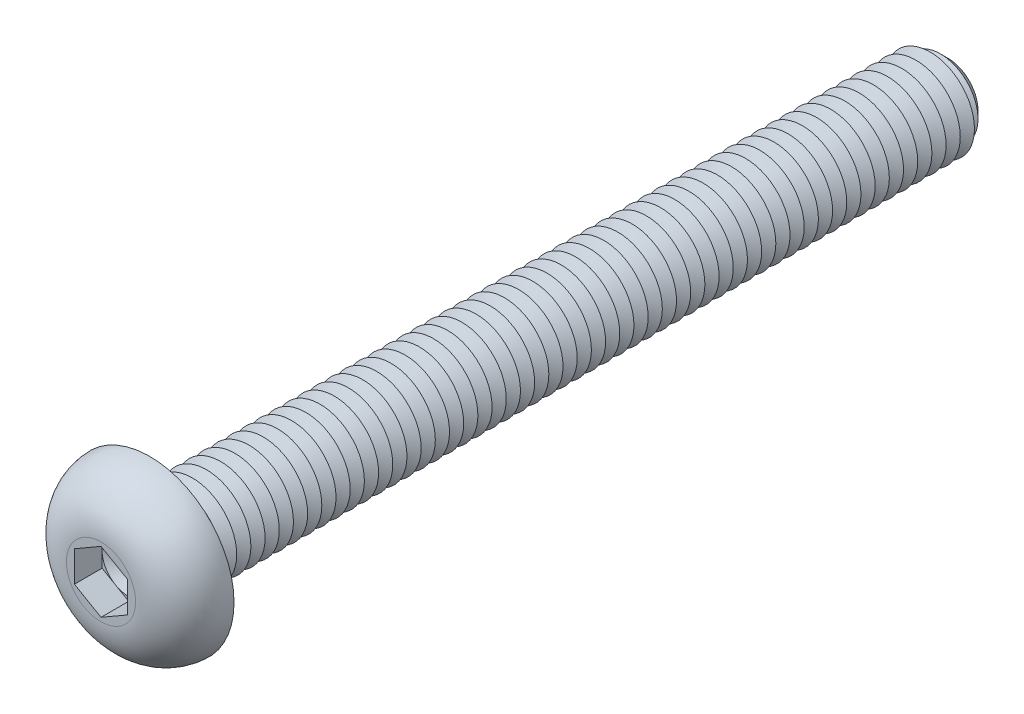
ISO-10303-21;
HEADER;
FILE_DESCRIPTION(('STEP AP214'),'2;1');
FILE_NAME('part.step','',(''),(''),'','','');
FILE_SCHEMA(('AUTOMOTIVE_DESIGN { 1 0 10303 214 1 1 1 1 }'));
ENDSEC;
DATA;
#1=APPLICATION_CONTEXT('core data for automotive mechanical design processes');
#2=APPLICATION_PROTOCOL_DEFINITION('international standard','automotive_design',2000,#1);
#3=PRODUCT_CONTEXT('',#1,'mechanical');
#4=PRODUCT('Part','Part','',(#3));
#5=PRODUCT_RELATED_PRODUCT_CATEGORY('part','',(#4));
#6=PRODUCT_DEFINITION_FORMATION('','',#4);
#7=PRODUCT_DEFINITION_CONTEXT('part definition',#1,'design');
#8=PRODUCT_DEFINITION('design','',#6,#7);
#9=PRODUCT_DEFINITION_SHAPE('','',#8);
#10=(LENGTH_UNIT() NAMED_UNIT(*) SI_UNIT(.MILLI.,.METRE.));
#11=(NAMED_UNIT(*) PLANE_ANGLE_UNIT() SI_UNIT($,.RADIAN.));
#12=(NAMED_UNIT(*) SI_UNIT($,.STERADIAN.) SOLID_ANGLE_UNIT());
#13=UNCERTAINTY_MEASURE_WITH_UNIT(LENGTH_MEASURE(1.E-05),#10,'distance_accuracy_value','');
#14=(GEOMETRIC_REPRESENTATION_CONTEXT(3) GLOBAL_UNCERTAINTY_ASSIGNED_CONTEXT((#13)) GLOBAL_UNIT_ASSIGNED_CONTEXT((#10,
#11,#12)) REPRESENTATION_CONTEXT('',''));
#15=CARTESIAN_POINT('',(0.,0.,0.));
#16=DIRECTION('',(0.,0.,1.));
#17=DIRECTION('',(1.,0.,0.));
#18=AXIS2_PLACEMENT_3D('',#15,#16,#17);
#19=CARTESIAN_POINT('',(0.,0.,1.19));
#20=DIRECTION('',(0.,0.,1.));
#21=DIRECTION('',(1.,0.,0.));
#22=AXIS2_PLACEMENT_3D('',#19,#20,#21);
#23=PLANE('',#22);
#24=CARTESIAN_POINT('',(0.,0.,1.19));
#25=DIRECTION('',(0.,0.,1.));
#26=DIRECTION('',(1.,0.,0.));
#27=AXIS2_PLACEMENT_3D('',#24,#25,#26);
#28=CIRCLE('',#27,1.5);
#29=CARTESIAN_POINT('',(1.5,0.,1.19));
#30=VERTEX_POINT('',#29);
#31=CARTESIAN_POINT('',(0.75,1.29903810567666,1.19));
#32=VERTEX_POINT('',#31);
#33=EDGE_CURVE('E117',#30,#32,#28,.T.);
#34=ORIENTED_EDGE('',*,*,#33,.F.);
#35=DIRECTION('',(0.,1.,0.));
#36=VECTOR('',#35,1.);
#37=CARTESIAN_POINT('',(1.5,-0.866025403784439,1.19));
#38=LINE('',#37,#36);
#39=CARTESIAN_POINT('',(1.5,0.86602540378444,1.19));
#40=VERTEX_POINT('',#39);
#41=EDGE_CURVE('E140',#30,#40,#38,.T.);
#42=ORIENTED_EDGE('',*,*,#41,.T.);
#43=DIRECTION('',(-0.866025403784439,0.5,0.));
#44=VECTOR('',#43,1.);
#45=CARTESIAN_POINT('',(1.5,0.86602540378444,1.19));
#46=LINE('',#45,#44);
#47=EDGE_CURVE('E135',#40,#32,#46,.T.);
#48=ORIENTED_EDGE('',*,*,#47,.T.);
#49=EDGE_LOOP('',(#34,#42,#48));
#50=FACE_BOUND('',#49,.T.);
#51=ADVANCED_FACE('F39',(#50),#23,.T.);
#52=CARTESIAN_POINT('',(0.,0.,1.19));
#53=DIRECTION('',(0.,0.,1.));
#54=DIRECTION('',(1.,0.,0.));
#55=AXIS2_PLACEMENT_3D('',#52,#53,#54);
#56=CIRCLE('',#55,1.5);
#57=CARTESIAN_POINT('',(-0.75,1.29903810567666,1.19));
#58=VERTEX_POINT('',#57);
#59=EDGE_CURVE('E11',#32,#58,#56,.T.);
#60=ORIENTED_EDGE('',*,*,#59,.F.);
#61=CARTESIAN_POINT('',(0.,1.73205080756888,1.19));
#62=VERTEX_POINT('',#61);
#63=EDGE_CURVE('E130',#32,#62,#46,.T.);
#64=ORIENTED_EDGE('',*,*,#63,.T.);
#65=DIRECTION('',(-0.866025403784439,-0.5,0.));
#66=VECTOR('',#65,1.);
#67=CARTESIAN_POINT('',(0.,1.73205080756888,1.19));
#68=LINE('',#67,#66);
#69=EDGE_CURVE('E132',#62,#58,#68,.T.);
#70=ORIENTED_EDGE('',*,*,#69,.T.);
#71=EDGE_LOOP('',(#60,#64,#70));
#72=FACE_BOUND('',#71,.T.);
#73=ADVANCED_FACE('F129',(#72),#23,.T.);
#74=CARTESIAN_POINT('',(-1.5,0.,1.19));
#75=VERTEX_POINT('',#74);
#76=EDGE_CURVE('E49',#58,#75,#56,.T.);
#77=ORIENTED_EDGE('',*,*,#76,.F.);
#78=CARTESIAN_POINT('',(-1.5,0.866025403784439,1.19));
#79=VERTEX_POINT('',#78);
#80=EDGE_CURVE('E143',#58,#79,#68,.T.);
#81=ORIENTED_EDGE('',*,*,#80,.T.);
#82=DIRECTION('',(0.,-1.,0.));
#83=VECTOR('',#82,1.);
#84=CARTESIAN_POINT('',(-1.5,0.866025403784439,1.19));
#85=LINE('',#84,#83);
#86=EDGE_CURVE('E154',#79,#75,#85,.T.);
#87=ORIENTED_EDGE('',*,*,#86,.T.);
#88=EDGE_LOOP('',(#77,#81,#87));
#89=FACE_BOUND('',#88,.T.);
#90=ADVANCED_FACE('F257',(#89),#23,.T.);
#91=CARTESIAN_POINT('',(-0.75,-1.29903810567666,1.19));
#92=VERTEX_POINT('',#91);
#93=EDGE_CURVE('E239',#75,#92,#56,.T.);
#94=ORIENTED_EDGE('',*,*,#93,.F.);
#95=CARTESIAN_POINT('',(-1.5,-0.866025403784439,1.19));
#96=VERTEX_POINT('',#95);
#97=EDGE_CURVE('E153',#75,#96,#85,.T.);
#98=ORIENTED_EDGE('',*,*,#97,.T.);
#99=DIRECTION('',(0.866025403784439,-0.5,0.));
#100=VECTOR('',#99,1.);
#101=CARTESIAN_POINT('',(-1.5,-0.866025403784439,1.19));
#102=LINE('',#101,#100);
#103=EDGE_CURVE('E159',#96,#92,#102,.T.);
#104=ORIENTED_EDGE('',*,*,#103,.T.);
#105=EDGE_LOOP('',(#94,#98,#104));
#106=FACE_BOUND('',#105,.T.);
#107=ADVANCED_FACE('F250',(#106),#23,.T.);
#108=CARTESIAN_POINT('',(0.75,-1.29903810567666,1.19));
#109=VERTEX_POINT('',#108);
#110=EDGE_CURVE('E56',#92,#109,#56,.T.);
#111=ORIENTED_EDGE('',*,*,#110,.F.);
#112=CARTESIAN_POINT('',(0.,-1.73205080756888,1.19));
#113=VERTEX_POINT('',#112);
#114=EDGE_CURVE('E158',#92,#113,#102,.T.);
#115=ORIENTED_EDGE('',*,*,#114,.T.);
#116=DIRECTION('',(0.866025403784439,0.5,0.));
#117=VECTOR('',#116,1.);
#118=CARTESIAN_POINT('',(0.,-1.73205080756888,1.19));
#119=LINE('',#118,#117);
#120=EDGE_CURVE('E164',#113,#109,#119,.T.);
#121=ORIENTED_EDGE('',*,*,#120,.T.);
#122=EDGE_LOOP('',(#111,#115,#121));
#123=FACE_BOUND('',#122,.T.);
#124=ADVANCED_FACE('F384',(#123),#23,.T.);
#125=CARTESIAN_POINT('',(0.,0.,-45.));
#126=DIRECTION('',(0.,0.,1.));
#127=DIRECTION('',(1.,0.,0.));
#128=AXIS2_PLACEMENT_3D('',#125,#126,#127);
#129=CYLINDRICAL_SURFACE('',#128,2.5);
#130=CARTESIAN_POINT('',(0.,0.,-0.399999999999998));
#131=DIRECTION('',(0.,0.,1.));
#132=DIRECTION('',(1.,0.,0.));
#133=AXIS2_PLACEMENT_3D('',#130,#131,#132);
#134=CIRCLE('',#133,2.5);
#135=CARTESIAN_POINT('',(2.5,0.,-0.400000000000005));
#136=VERTEX_POINT('',#135);
#137=EDGE_CURVE('E222',#136,#136,#134,.F.);
#138=CARTESIAN_POINT('',(0.,0.,-0.800000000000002));
#139=DIRECTION('',(0.,0.,1.));
#140=DIRECTION('',(1.,0.,0.));
#141=AXIS2_PLACEMENT_3D('',#138,#139,#140);
#142=CIRCLE('',#141,2.5);
#143=CARTESIAN_POINT('',(2.5,0.,-0.800000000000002));
#144=VERTEX_POINT('',#143);
#145=EDGE_CURVE('E149',#144,#144,#142,.T.);
#146=CARTESIAN_POINT('',(2.5,0.,-0.400000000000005));
#147=CARTESIAN_POINT('',(2.5,0.,-0.404166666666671));
#148=CARTESIAN_POINT('',(2.5,0.,-0.408333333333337));
#149=CARTESIAN_POINT('',(2.5,0.,-0.416666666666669));
#150=CARTESIAN_POINT('',(2.5,0.,-0.420833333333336));
#151=CARTESIAN_POINT('',(2.5,0.,-0.42916666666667));
#152=CARTESIAN_POINT('',(2.5,0.,-0.433333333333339));
#153=CARTESIAN_POINT('',(2.5,0.,-0.441666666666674));
#154=CARTESIAN_POINT('',(2.5,0.,-0.44583333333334));
#155=CARTESIAN_POINT('',(2.5,0.,-0.454166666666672));
#156=CARTESIAN_POINT('',(2.5,0.,-0.458333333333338));
#157=CARTESIAN_POINT('',(2.5,0.,-0.466666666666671));
#158=CARTESIAN_POINT('',(2.5,0.,-0.470833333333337));
#159=CARTESIAN_POINT('',(2.5,0.,-0.479166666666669));
#160=CARTESIAN_POINT('',(2.5,0.,-0.483333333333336));
#161=CARTESIAN_POINT('',(2.5,0.,-0.49166666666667));
#162=CARTESIAN_POINT('',(2.5,0.,-0.495833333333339));
#163=CARTESIAN_POINT('',(2.5,0.,-0.504166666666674));
#164=CARTESIAN_POINT('',(2.5,0.,-0.50833333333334));
#165=CARTESIAN_POINT('',(2.5,0.,-0.516666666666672));
#166=CARTESIAN_POINT('',(2.5,0.,-0.520833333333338));
#167=CARTESIAN_POINT('',(2.5,0.,-0.529166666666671));
#168=CARTESIAN_POINT('',(2.5,0.,-0.533333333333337));
#169=CARTESIAN_POINT('',(2.5,0.,-0.541666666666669));
#170=CARTESIAN_POINT('',(2.5,0.,-0.545833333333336));
#171=CARTESIAN_POINT('',(2.5,0.,-0.554166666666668));
#172=CARTESIAN_POINT('',(2.5,0.,-0.558333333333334));
#173=CARTESIAN_POINT('',(2.5,0.,-0.566666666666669));
#174=CARTESIAN_POINT('',(2.5,0.,-0.570833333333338));
#175=CARTESIAN_POINT('',(2.5,0.,-0.579166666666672));
#176=CARTESIAN_POINT('',(2.5,0.,-0.583333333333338));
#177=CARTESIAN_POINT('',(2.5,0.,-0.591666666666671));
#178=CARTESIAN_POINT('',(2.5,0.,-0.595833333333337));
#179=CARTESIAN_POINT('',(2.5,0.,-0.60416666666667));
#180=CARTESIAN_POINT('',(2.5,0.,-0.608333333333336));
#181=CARTESIAN_POINT('',(2.5,0.,-0.616666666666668));
#182=CARTESIAN_POINT('',(2.5,0.,-0.620833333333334));
#183=CARTESIAN_POINT('',(2.5,0.,-0.629166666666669));
#184=CARTESIAN_POINT('',(2.5,0.,-0.633333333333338));
#185=CARTESIAN_POINT('',(2.5,0.,-0.641666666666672));
#186=CARTESIAN_POINT('',(2.5,0.,-0.645833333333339));
#187=CARTESIAN_POINT('',(2.5,0.,-0.654166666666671));
#188=CARTESIAN_POINT('',(2.5,0.,-0.658333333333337));
#189=CARTESIAN_POINT('',(2.5,0.,-0.66666666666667));
#190=CARTESIAN_POINT('',(2.5,0.,-0.670833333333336));
#191=CARTESIAN_POINT('',(2.5,0.,-0.679166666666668));
#192=CARTESIAN_POINT('',(2.5,0.,-0.683333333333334));
#193=CARTESIAN_POINT('',(2.5,0.,-0.691666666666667));
#194=CARTESIAN_POINT('',(2.5,0.,-0.695833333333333));
#195=CARTESIAN_POINT('',(2.5,0.,-0.704166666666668));
#196=CARTESIAN_POINT('',(2.5,0.,-0.708333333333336));
#197=CARTESIAN_POINT('',(2.5,0.,-0.716666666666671));
#198=CARTESIAN_POINT('',(2.5,0.,-0.720833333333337));
#199=CARTESIAN_POINT('',(2.5,0.,-0.72916666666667));
#200=CARTESIAN_POINT('',(2.5,0.,-0.733333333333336));
#201=CARTESIAN_POINT('',(2.5,0.,-0.741666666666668));
#202=CARTESIAN_POINT('',(2.5,0.,-0.745833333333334));
#203=CARTESIAN_POINT('',(2.5,0.,-0.754166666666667));
#204=CARTESIAN_POINT('',(2.5,0.,-0.758333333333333));
#205=CARTESIAN_POINT('',(2.5,0.,-0.766666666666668));
#206=CARTESIAN_POINT('',(2.5,0.,-0.770833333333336));
#207=CARTESIAN_POINT('',(2.5,0.,-0.779166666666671));
#208=CARTESIAN_POINT('',(2.5,0.,-0.783333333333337));
#209=CARTESIAN_POINT('',(2.5,0.,-0.79166666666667));
#210=CARTESIAN_POINT('',(2.5,0.,-0.795833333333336));
#211=CARTESIAN_POINT('',(2.5,0.,-0.800000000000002));
#212=B_SPLINE_CURVE_WITH_KNOTS('',3,(#146,#147,#148,#149,#150,#151,#152,#153,#154,#155,#156,
#157,#158,#159,#160,#161,#162,#163,#164,#165,#166,#167,#168,#169,#170,#171,#172,#173,#174,#175,
#176,#177,#178,#179,#180,#181,#182,#183,#184,#185,#186,#187,#188,#189,#190,#191,#192,#193,#194,
#195,#196,#197,#198,#199,#200,#201,#202,#203,#204,#205,#206,#207,#208,#209,#210,#211),
.UNSPECIFIED.,.F.,.F.,(4,2,2,2,2,2,2,2,2,2,2,2,2,2,2,2,2,2,2,2,2,2,2,2,2,2,2,2,2,2,2,2,4),(0.,
0.0124999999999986,0.0249999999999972,0.0375000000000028,0.0500000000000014,0.0625000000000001,
0.0749999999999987,0.0874999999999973,0.100000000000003,0.112500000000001,0.125,
0.137499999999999,0.149999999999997,0.162499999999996,0.175000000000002,0.1875,
0.199999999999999,0.212499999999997,0.224999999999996,0.237500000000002,0.25,0.262499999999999,
0.274999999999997,0.287499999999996,0.299999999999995,0.3125,0.324999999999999,
0.337499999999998,0.349999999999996,0.362499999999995,0.375,0.387499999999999,
0.399999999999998),.UNSPECIFIED.);
#213=EDGE_CURVE('BSEAM368',#136,#144,#212,.T.);
#214=ORIENTED_EDGE('',*,*,#137,.T.);
#215=ORIENTED_EDGE('',*,*,#145,.T.);
#216=ORIENTED_EDGE('',*,*,#213,.T.);
#217=ORIENTED_EDGE('',*,*,#213,.F.);
#218=EDGE_LOOP('',(#214,#216,#215,#217));
#219=FACE_BOUND('',#218,.T.);
#220=ADVANCED_FACE('F368',(#219),#129,.T.);
#221=CARTESIAN_POINT('',(0.,4.75,0.));
#222=DIRECTION('',(0.,0.,1.));
#223=DIRECTION('',(1.,0.,0.));
#224=AXIS2_PLACEMENT_3D('',#221,#222,#223);
#225=PLANE('',#224);
#226=CARTESIAN_POINT('',(0.,0.,0.));
#227=DIRECTION('',(0.,0.,1.));
#228=DIRECTION('',(1.,0.,0.));
#229=AXIS2_PLACEMENT_3D('',#226,#227,#228);
#230=CIRCLE('',#229,2.9);
#231=CARTESIAN_POINT('',(2.9,0.,0.));
#232=VERTEX_POINT('',#231);
#233=EDGE_CURVE('E231',#232,#232,#230,.T.);
#234=ORIENTED_EDGE('',*,*,#233,.T.);
#235=EDGE_LOOP('',(#234));
#236=FACE_BOUND('',#235,.T.);
#237=CARTESIAN_POINT('',(0.,0.,0.));
#238=DIRECTION('',(0.,0.,1.));
#239=DIRECTION('',(1.,0.,0.));
#240=AXIS2_PLACEMENT_3D('',#237,#238,#239);
#241=CIRCLE('',#240,4.75);
#242=CARTESIAN_POINT('',(4.75,0.,0.));
#243=VERTEX_POINT('',#242);
#244=EDGE_CURVE('E196',#243,#243,#241,.T.);
#245=ORIENTED_EDGE('',*,*,#244,.F.);
#246=EDGE_LOOP('',(#245));
#247=FACE_BOUND('',#246,.T.);
#248=ADVANCED_FACE('F414',(#236,#247),#225,.F.);
#249=CARTESIAN_POINT('',(0.,0.,2.75));
#250=DIRECTION('',(0.,0.,-1.));
#251=DIRECTION('',(-1.,0.,0.));
#252=AXIS2_PLACEMENT_3D('',#249,#250,#251);
#253=PLANE('',#252);
#254=DIRECTION('',(-0.866025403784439,-0.5,0.));
#255=VECTOR('',#254,1.);
#256=CARTESIAN_POINT('',(0.,1.73205080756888,2.75));
#257=LINE('',#256,#255);
#258=CARTESIAN_POINT('',(0.,1.73205080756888,2.75));
#259=VERTEX_POINT('',#258);
#260=CARTESIAN_POINT('',(-1.5,0.866025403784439,2.75));
#261=VERTEX_POINT('',#260);
#262=EDGE_CURVE('E174',#259,#261,#257,.T.);
#263=ORIENTED_EDGE('',*,*,#262,.F.);
#264=DIRECTION('',(-0.866025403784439,0.5,0.));
#265=VECTOR('',#264,1.);
#266=CARTESIAN_POINT('',(1.5,0.86602540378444,2.75));
#267=LINE('',#266,#265);
#268=CARTESIAN_POINT('',(1.5,0.86602540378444,2.75));
#269=VERTEX_POINT('',#268);
#270=EDGE_CURVE('E64',#269,#259,#267,.T.);
#271=ORIENTED_EDGE('',*,*,#270,.F.);
#272=DIRECTION('',(0.,1.,0.));
#273=VECTOR('',#272,1.);
#274=CARTESIAN_POINT('',(1.5,-0.866025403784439,2.75));
#275=LINE('',#274,#273);
#276=CARTESIAN_POINT('',(1.5,-0.866025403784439,2.75));
#277=VERTEX_POINT('',#276);
#278=EDGE_CURVE('E138',#277,#269,#275,.T.);
#279=ORIENTED_EDGE('',*,*,#278,.F.);
#280=DIRECTION('',(0.866025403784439,0.5,0.));
#281=VECTOR('',#280,1.);
#282=CARTESIAN_POINT('',(0.,-1.73205080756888,2.75));
#283=LINE('',#282,#281);
#284=CARTESIAN_POINT('',(0.,-1.73205080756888,2.75));
#285=VERTEX_POINT('',#284);
#286=EDGE_CURVE('E186',#285,#277,#283,.T.);
#287=ORIENTED_EDGE('',*,*,#286,.F.);
#288=DIRECTION('',(0.866025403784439,-0.5,0.));
#289=VECTOR('',#288,1.);
#290=CARTESIAN_POINT('',(-1.5,-0.866025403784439,2.75));
#291=LINE('',#290,#289);
#292=CARTESIAN_POINT('',(-1.5,-0.866025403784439,2.75));
#293=VERTEX_POINT('',#292);
#294=EDGE_CURVE('E182',#293,#285,#291,.T.);
#295=ORIENTED_EDGE('',*,*,#294,.F.);
#296=DIRECTION('',(0.,-1.,0.));
#297=VECTOR('',#296,1.);
#298=CARTESIAN_POINT('',(-1.5,0.866025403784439,2.75));
#299=LINE('',#298,#297);
#300=EDGE_CURVE('E178',#261,#293,#299,.T.);
#301=ORIENTED_EDGE('',*,*,#300,.F.);
#302=EDGE_LOOP('',(#263,#271,#279,#287,#295,#301));
#303=FACE_BOUND('',#302,.T.);
#304=CARTESIAN_POINT('',(0.,0.,2.75));
#305=DIRECTION('',(0.,0.,1.));
#306=DIRECTION('',(1.,0.,0.));
#307=AXIS2_PLACEMENT_3D('',#304,#305,#306);
#308=CIRCLE('',#307,1.95044646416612);
#309=CARTESIAN_POINT('',(1.95044646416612,0.,2.75));
#310=VERTEX_POINT('',#309);
#311=EDGE_CURVE('E214',#310,#310,#308,.T.);
#312=ORIENTED_EDGE('',*,*,#311,.T.);
#313=EDGE_LOOP('',(#312));
#314=FACE_BOUND('',#313,.T.);
#315=ADVANCED_FACE('F266',(#303,#314),#253,.F.);
#316=CARTESIAN_POINT('',(0.,0.,-0.0500000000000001));
#317=DIRECTION('',(0.,0.,1.));
#318=DIRECTION('',(1.,0.,0.));
#319=AXIS2_PLACEMENT_3D('',#316,#317,#318);
#320=DEGENERATE_TOROIDAL_SURFACE('',#319,1.95044646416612,2.8,.T.);
#321=ORIENTED_EDGE('',*,*,#311,.F.);
#322=EDGE_LOOP('',(#321));
#323=FACE_BOUND('',#322,.T.);
#324=ORIENTED_EDGE('',*,*,#244,.T.);
#325=EDGE_LOOP('',(#324));
#326=FACE_BOUND('',#325,.T.);
#327=ADVANCED_FACE('F408',(#323,#326),#320,.T.);
#328=CARTESIAN_POINT('',(1.5,0.86602540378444,1.19));
#329=DIRECTION('',(0.5,0.866025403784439,0.));
#330=DIRECTION('',(-0.866025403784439,0.5,0.));
#331=AXIS2_PLACEMENT_3D('',#328,#329,#330);
#332=PLANE('',#331);
#333=ORIENTED_EDGE('',*,*,#270,.T.);
#334=DIRECTION('',(0.,0.,1.));
#335=VECTOR('',#334,1.);
#336=CARTESIAN_POINT('',(0.,1.73205080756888,1.19));
#337=LINE('',#336,#335);
#338=EDGE_CURVE('E136',#62,#259,#337,.T.);
#339=ORIENTED_EDGE('',*,*,#338,.F.);
#340=ORIENTED_EDGE('',*,*,#63,.F.);
#341=ORIENTED_EDGE('',*,*,#47,.F.);
#342=DIRECTION('',(0.,0.,1.));
#343=VECTOR('',#342,1.);
#344=CARTESIAN_POINT('',(1.5,0.86602540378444,1.19));
#345=LINE('',#344,#343);
#346=EDGE_CURVE('E193',#40,#269,#345,.T.);
#347=ORIENTED_EDGE('',*,*,#346,.T.);
#348=EDGE_LOOP('',(#333,#339,#340,#341,#347));
#349=FACE_BOUND('',#348,.T.);
#350=ADVANCED_FACE('F134',(#349),#332,.F.);
#351=CARTESIAN_POINT('',(1.5,-0.866025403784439,1.19));
#352=DIRECTION('',(1.,0.,0.));
#353=DIRECTION('',(0.,1.,0.));
#354=AXIS2_PLACEMENT_3D('',#351,#352,#353);
#355=PLANE('',#354);
#356=ORIENTED_EDGE('',*,*,#278,.T.);
#357=ORIENTED_EDGE('',*,*,#346,.F.);
#358=ORIENTED_EDGE('',*,*,#41,.F.);
#359=CARTESIAN_POINT('',(1.5,-0.866025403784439,1.19));
#360=VERTEX_POINT('',#359);
#361=EDGE_CURVE('E168',#360,#30,#38,.T.);
#362=ORIENTED_EDGE('',*,*,#361,.F.);
#363=DIRECTION('',(0.,0.,1.));
#364=VECTOR('',#363,1.);
#365=CARTESIAN_POINT('',(1.5,-0.866025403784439,1.19));
#366=LINE('',#365,#364);
#367=EDGE_CURVE('E197',#360,#277,#366,.T.);
#368=ORIENTED_EDGE('',*,*,#367,.T.);
#369=EDGE_LOOP('',(#356,#357,#358,#362,#368));
#370=FACE_BOUND('',#369,.T.);
#371=ADVANCED_FACE('F392',(#370),#355,.F.);
#372=CARTESIAN_POINT('',(0.,-1.73205080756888,1.19));
#373=DIRECTION('',(0.5,-0.866025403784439,0.));
#374=DIRECTION('',(0.866025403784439,0.5,0.));
#375=AXIS2_PLACEMENT_3D('',#372,#373,#374);
#376=PLANE('',#375);
#377=ORIENTED_EDGE('',*,*,#286,.T.);
#378=ORIENTED_EDGE('',*,*,#367,.F.);
#379=EDGE_CURVE('E163',#109,#360,#119,.T.);
#380=ORIENTED_EDGE('',*,*,#379,.F.);
#381=ORIENTED_EDGE('',*,*,#120,.F.);
#382=DIRECTION('',(0.,0.,1.));
#383=VECTOR('',#382,1.);
#384=CARTESIAN_POINT('',(0.,-1.73205080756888,1.19));
#385=LINE('',#384,#383);
#386=EDGE_CURVE('E200',#113,#285,#385,.T.);
#387=ORIENTED_EDGE('',*,*,#386,.T.);
#388=EDGE_LOOP('',(#377,#378,#380,#381,#387));
#389=FACE_BOUND('',#388,.T.);
#390=ADVANCED_FACE('F395',(#389),#376,.F.);
#391=CARTESIAN_POINT('',(-1.5,-0.866025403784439,1.19));
#392=DIRECTION('',(-0.5,-0.866025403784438,0.));
#393=DIRECTION('',(0.866025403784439,-0.5,0.));
#394=AXIS2_PLACEMENT_3D('',#391,#392,#393);
#395=PLANE('',#394);
#396=ORIENTED_EDGE('',*,*,#294,.T.);
#397=ORIENTED_EDGE('',*,*,#386,.F.);
#398=ORIENTED_EDGE('',*,*,#114,.F.);
#399=ORIENTED_EDGE('',*,*,#103,.F.);
#400=DIRECTION('',(0.,0.,1.));
#401=VECTOR('',#400,1.);
#402=CARTESIAN_POINT('',(-1.5,-0.866025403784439,1.19));
#403=LINE('',#402,#401);
#404=EDGE_CURVE('E203',#96,#293,#403,.T.);
#405=ORIENTED_EDGE('',*,*,#404,.T.);
#406=EDGE_LOOP('',(#396,#397,#398,#399,#405));
#407=FACE_BOUND('',#406,.T.);
#408=ADVANCED_FACE('F271',(#407),#395,.F.);
#409=CARTESIAN_POINT('',(-1.5,0.866025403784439,1.19));
#410=DIRECTION('',(-1.,0.,0.));
#411=DIRECTION('',(0.,-1.,0.));
#412=AXIS2_PLACEMENT_3D('',#409,#410,#411);
#413=PLANE('',#412);
#414=ORIENTED_EDGE('',*,*,#300,.T.);
#415=ORIENTED_EDGE('',*,*,#404,.F.);
#416=ORIENTED_EDGE('',*,*,#97,.F.);
#417=ORIENTED_EDGE('',*,*,#86,.F.);
#418=DIRECTION('',(0.,0.,1.));
#419=VECTOR('',#418,1.);
#420=CARTESIAN_POINT('',(-1.5,0.866025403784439,1.19));
#421=LINE('',#420,#419);
#422=EDGE_CURVE('E206',#79,#261,#421,.T.);
#423=ORIENTED_EDGE('',*,*,#422,.T.);
#424=EDGE_LOOP('',(#414,#415,#416,#417,#423));
#425=FACE_BOUND('',#424,.T.);
#426=ADVANCED_FACE('F255',(#425),#413,.F.);
#427=CARTESIAN_POINT('',(0.,1.73205080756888,1.19));
#428=DIRECTION('',(-0.5,0.866025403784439,0.));
#429=DIRECTION('',(-0.866025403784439,-0.5,0.));
#430=AXIS2_PLACEMENT_3D('',#427,#428,#429);
#431=PLANE('',#430);
#432=ORIENTED_EDGE('',*,*,#262,.T.);
#433=ORIENTED_EDGE('',*,*,#422,.F.);
#434=ORIENTED_EDGE('',*,*,#80,.F.);
#435=ORIENTED_EDGE('',*,*,#69,.F.);
#436=ORIENTED_EDGE('',*,*,#338,.T.);
#437=EDGE_LOOP('',(#432,#433,#434,#435,#436));
#438=FACE_BOUND('',#437,.T.);
#439=ADVANCED_FACE('F260',(#438),#431,.F.);
#440=EDGE_CURVE('E43',#109,#30,#56,.T.);
#441=ORIENTED_EDGE('',*,*,#440,.F.);
#442=ORIENTED_EDGE('',*,*,#379,.T.);
#443=ORIENTED_EDGE('',*,*,#361,.T.);
#444=EDGE_LOOP('',(#441,#442,#443));
#445=FACE_BOUND('',#444,.T.);
#446=ADVANCED_FACE('F373',(#445),#23,.T.);
#447=CARTESIAN_POINT('',(0.,0.,-0.800000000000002));
#448=DIRECTION('',(0.,0.,1.));
#449=DIRECTION('',(1.,0.,0.));
#450=AXIS2_PLACEMENT_3D('',#447,#448,#449);
#451=CONICAL_SURFACE('',#450,2.5,1.0471975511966);
#452=CARTESIAN_POINT('',(0.,0.,-1.2));
#453=DIRECTION('',(0.,0.,1.));
#454=DIRECTION('',(1.,0.,0.));
#455=AXIS2_PLACEMENT_3D('',#452,#453,#454);
#456=CIRCLE('',#455,1.80717967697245);
#457=CARTESIAN_POINT('',(1.80717967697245,0.,-1.2));
#458=VERTEX_POINT('',#457);
#459=EDGE_CURVE('E357',#458,#458,#456,.T.);
#460=ORIENTED_EDGE('',*,*,#459,.T.);
#461=EDGE_LOOP('',(#460));
#462=FACE_BOUND('',#461,.T.);
#463=ORIENTED_EDGE('',*,*,#145,.F.);
#464=EDGE_LOOP('',(#463));
#465=FACE_BOUND('',#464,.T.);
#466=ADVANCED_FACE('F370',(#462,#465),#451,.T.);
#467=CARTESIAN_POINT('',(0.,0.,-1.2));
#468=DIRECTION('',(0.,0.,-1.));
#469=DIRECTION('',(-1.,0.,0.));
#470=AXIS2_PLACEMENT_3D('',#467,#468,#469);
#471=CONICAL_SURFACE('',#470,1.80717967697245,1.04719755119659);
#472=CARTESIAN_POINT('',(0.,0.,-1.6));
#473=DIRECTION('',(0.,0.,1.));
#474=DIRECTION('',(1.,0.,0.));
#475=AXIS2_PLACEMENT_3D('',#472,#473,#474);
#476=CIRCLE('',#475,2.5);
#477=CARTESIAN_POINT('',(2.5,0.,-1.6));
#478=VERTEX_POINT('',#477);
#479=EDGE_CURVE('E355',#478,#478,#476,.T.);
#480=ORIENTED_EDGE('',*,*,#479,.T.);
#481=EDGE_LOOP('',(#480));
#482=FACE_BOUND('',#481,.T.);
#483=ORIENTED_EDGE('',*,*,#459,.F.);
#484=EDGE_LOOP('',(#483));
#485=FACE_BOUND('',#484,.T.);
#486=ADVANCED_FACE('F372',(#482,#485),#471,.T.);
#487=CARTESIAN_POINT('',(0.,0.,-1.6));
#488=DIRECTION('',(0.,0.,1.));
#489=DIRECTION('',(1.,0.,0.));
#490=AXIS2_PLACEMENT_3D('',#487,#488,#489);
#491=CONICAL_SURFACE('',#490,2.5,1.0471975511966);
#492=CARTESIAN_POINT('',(0.,0.,-2.));
#493=DIRECTION('',(0.,0.,1.));
#494=DIRECTION('',(1.,0.,0.));
#495=AXIS2_PLACEMENT_3D('',#492,#493,#494);
#496=CIRCLE('',#495,1.80717967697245);
#497=CARTESIAN_POINT('',(1.80717967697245,0.,-2.));
#498=VERTEX_POINT('',#497);
#499=EDGE_CURVE('E278',#498,#498,#496,.T.);
#500=ORIENTED_EDGE('',*,*,#499,.T.);
#501=EDGE_LOOP('',(#500));
#502=FACE_BOUND('',#501,.T.);
#503=ORIENTED_EDGE('',*,*,#479,.F.);
#504=EDGE_LOOP('',(#503));
#505=FACE_BOUND('',#504,.T.);
#506=ADVANCED_FACE('F379',(#502,#505),#491,.T.);
#507=CARTESIAN_POINT('',(0.,0.,-2.));
#508=DIRECTION('',(0.,0.,-1.));
#509=DIRECTION('',(-1.,0.,0.));
#510=AXIS2_PLACEMENT_3D('',#507,#508,#509);
#511=CONICAL_SURFACE('',#510,1.80717967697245,1.04719755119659);
#512=CARTESIAN_POINT('',(0.,0.,-2.4));
#513=DIRECTION('',(0.,0.,1.));
#514=DIRECTION('',(1.,0.,0.));
#515=AXIS2_PLACEMENT_3D('',#512,#513,#514);
#516=CIRCLE('',#515,2.5);
#517=CARTESIAN_POINT('',(2.5,0.,-2.4));
#518=VERTEX_POINT('',#517);
#519=EDGE_CURVE('E349',#518,#518,#516,.T.);
#520=ORIENTED_EDGE('',*,*,#519,.T.);
#521=EDGE_LOOP('',(#520));
#522=FACE_BOUND('',#521,.T.);
#523=ORIENTED_EDGE('',*,*,#499,.F.);
#524=EDGE_LOOP('',(#523));
#525=FACE_BOUND('',#524,.T.);
#526=ADVANCED_FACE('F829',(#522,#525),#511,.T.);
#527=CARTESIAN_POINT('',(0.,0.,-2.4));
#528=DIRECTION('',(0.,0.,1.));
#529=DIRECTION('',(1.,0.,0.));
#530=AXIS2_PLACEMENT_3D('',#527,#528,#529);
#531=CONICAL_SURFACE('',#530,2.5,1.0471975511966);
#532=CARTESIAN_POINT('',(0.,0.,-2.8));
#533=DIRECTION('',(0.,0.,1.));
#534=DIRECTION('',(1.,0.,0.));
#535=AXIS2_PLACEMENT_3D('',#532,#533,#534);
#536=CIRCLE('',#535,1.80717967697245);
#537=CARTESIAN_POINT('',(1.80717967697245,0.,-2.8));
#538=VERTEX_POINT('',#537);
#539=EDGE_CURVE('E346',#538,#538,#536,.T.);
#540=ORIENTED_EDGE('',*,*,#539,.T.);
#541=EDGE_LOOP('',(#540));
#542=FACE_BOUND('',#541,.T.);
#543=ORIENTED_EDGE('',*,*,#519,.F.);
#544=EDGE_LOOP('',(#543));
#545=FACE_BOUND('',#544,.T.);
#546=ADVANCED_FACE('F825',(#542,#545),#531,.T.);
#547=CARTESIAN_POINT('',(0.,0.,-2.8));
#548=DIRECTION('',(0.,0.,-1.));
#549=DIRECTION('',(-1.,0.,0.));
#550=AXIS2_PLACEMENT_3D('',#547,#548,#549);
#551=CONICAL_SURFACE('',#550,1.80717967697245,1.04719755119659);
#552=CARTESIAN_POINT('',(0.,0.,-3.2));
#553=DIRECTION('',(0.,0.,1.));
#554=DIRECTION('',(1.,0.,0.));
#555=AXIS2_PLACEMENT_3D('',#552,#553,#554);
#556=CIRCLE('',#555,2.5);
#557=CARTESIAN_POINT('',(2.5,0.,-3.2));
#558=VERTEX_POINT('',#557);
#559=EDGE_CURVE('E342',#558,#558,#556,.T.);
#560=ORIENTED_EDGE('',*,*,#559,.T.);
#561=EDGE_LOOP('',(#560));
#562=FACE_BOUND('',#561,.T.);
#563=ORIENTED_EDGE('',*,*,#539,.F.);
#564=EDGE_LOOP('',(#563));
#565=FACE_BOUND('',#564,.T.);
#566=ADVANCED_FACE('F821',(#562,#565),#551,.T.);
#567=CARTESIAN_POINT('',(0.,0.,-3.2));
#568=DIRECTION('',(0.,0.,1.));
#569=DIRECTION('',(1.,0.,0.));
#570=AXIS2_PLACEMENT_3D('',#567,#568,#569);
#571=CONICAL_SURFACE('',#570,2.5,1.0471975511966);
#572=CARTESIAN_POINT('',(0.,0.,-3.6));
#573=DIRECTION('',(0.,0.,1.));
#574=DIRECTION('',(1.,0.,0.));
#575=AXIS2_PLACEMENT_3D('',#572,#573,#574);
#576=CIRCLE('',#575,1.80717967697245);
#577=CARTESIAN_POINT('',(1.80717967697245,0.,-3.6));
#578=VERTEX_POINT('',#577);
#579=EDGE_CURVE('E338',#578,#578,#576,.T.);
#580=ORIENTED_EDGE('',*,*,#579,.T.);
#581=EDGE_LOOP('',(#580));
#582=FACE_BOUND('',#581,.T.);
#583=ORIENTED_EDGE('',*,*,#559,.F.);
#584=EDGE_LOOP('',(#583));
#585=FACE_BOUND('',#584,.T.);
#586=ADVANCED_FACE('F817',(#582,#585),#571,.T.);
#587=CARTESIAN_POINT('',(0.,0.,-3.6));
#588=DIRECTION('',(0.,0.,-1.));
#589=DIRECTION('',(-1.,0.,0.));
#590=AXIS2_PLACEMENT_3D('',#587,#588,#589);
#591=CONICAL_SURFACE('',#590,1.80717967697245,1.04719755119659);
#592=CARTESIAN_POINT('',(0.,0.,-4.));
#593=DIRECTION('',(0.,0.,1.));
#594=DIRECTION('',(1.,0.,0.));
#595=AXIS2_PLACEMENT_3D('',#592,#593,#594);
#596=CIRCLE('',#595,2.5);
#597=CARTESIAN_POINT('',(2.5,0.,-4.));
#598=VERTEX_POINT('',#597);
#599=EDGE_CURVE('E334',#598,#598,#596,.T.);
#600=ORIENTED_EDGE('',*,*,#599,.T.);
#601=EDGE_LOOP('',(#600));
#602=FACE_BOUND('',#601,.T.);
#603=ORIENTED_EDGE('',*,*,#579,.F.);
#604=EDGE_LOOP('',(#603));
#605=FACE_BOUND('',#604,.T.);
#606=ADVANCED_FACE('F813',(#602,#605),#591,.T.);
#607=CARTESIAN_POINT('',(0.,0.,-4.));
#608=DIRECTION('',(0.,0.,1.));
#609=DIRECTION('',(1.,0.,0.));
#610=AXIS2_PLACEMENT_3D('',#607,#608,#609);
#611=CONICAL_SURFACE('',#610,2.5,1.0471975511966);
#612=CARTESIAN_POINT('',(0.,0.,-4.4));
#613=DIRECTION('',(0.,0.,1.));
#614=DIRECTION('',(1.,0.,0.));
#615=AXIS2_PLACEMENT_3D('',#612,#613,#614);
#616=CIRCLE('',#615,1.80717967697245);
#617=CARTESIAN_POINT('',(1.80717967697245,0.,-4.4));
#618=VERTEX_POINT('',#617);
#619=EDGE_CURVE('E324',#618,#618,#616,.T.);
#620=ORIENTED_EDGE('',*,*,#619,.T.);
#621=EDGE_LOOP('',(#620));
#622=FACE_BOUND('',#621,.T.);
#623=ORIENTED_EDGE('',*,*,#599,.F.);
#624=EDGE_LOOP('',(#623));
#625=FACE_BOUND('',#624,.T.);
#626=ADVANCED_FACE('F809',(#622,#625),#611,.T.);
#627=CARTESIAN_POINT('',(0.,0.,-4.4));
#628=DIRECTION('',(0.,0.,-1.));
#629=DIRECTION('',(-1.,0.,0.));
#630=AXIS2_PLACEMENT_3D('',#627,#628,#629);
#631=CONICAL_SURFACE('',#630,1.80717967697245,1.04719755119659);
#632=CARTESIAN_POINT('',(0.,0.,-4.8));
#633=DIRECTION('',(0.,0.,1.));
#634=DIRECTION('',(1.,0.,0.));
#635=AXIS2_PLACEMENT_3D('',#632,#633,#634);
#636=CIRCLE('',#635,2.5);
#637=CARTESIAN_POINT('',(2.5,0.,-4.8));
#638=VERTEX_POINT('',#637);
#639=EDGE_CURVE('E317',#638,#638,#636,.T.);
#640=ORIENTED_EDGE('',*,*,#639,.T.);
#641=EDGE_LOOP('',(#640));
#642=FACE_BOUND('',#641,.T.);
#643=ORIENTED_EDGE('',*,*,#619,.F.);
#644=EDGE_LOOP('',(#643));
#645=FACE_BOUND('',#644,.T.);
#646=ADVANCED_FACE('F806',(#642,#645),#631,.T.);
#647=CARTESIAN_POINT('',(0.,0.,-4.8));
#648=DIRECTION('',(0.,0.,1.));
#649=DIRECTION('',(1.,0.,0.));
#650=AXIS2_PLACEMENT_3D('',#647,#648,#649);
#651=CONICAL_SURFACE('',#650,2.5,1.0471975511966);
#652=CARTESIAN_POINT('',(0.,0.,-5.2));
#653=DIRECTION('',(0.,0.,1.));
#654=DIRECTION('',(1.,0.,0.));
#655=AXIS2_PLACEMENT_3D('',#652,#653,#654);
#656=CIRCLE('',#655,1.80717967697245);
#657=CARTESIAN_POINT('',(1.80717967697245,0.,-5.2));
#658=VERTEX_POINT('',#657);
#659=EDGE_CURVE('E315',#658,#658,#656,.T.);
#660=ORIENTED_EDGE('',*,*,#659,.T.);
#661=EDGE_LOOP('',(#660));
#662=FACE_BOUND('',#661,.T.);
#663=ORIENTED_EDGE('',*,*,#639,.F.);
#664=EDGE_LOOP('',(#663));
#665=FACE_BOUND('',#664,.T.);
#666=ADVANCED_FACE('F802',(#662,#665),#651,.T.);
#667=CARTESIAN_POINT('',(0.,0.,-5.2));
#668=DIRECTION('',(0.,0.,-1.));
#669=DIRECTION('',(-1.,0.,0.));
#670=AXIS2_PLACEMENT_3D('',#667,#668,#669);
#671=CONICAL_SURFACE('',#670,1.80717967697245,1.04719755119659);
#672=CARTESIAN_POINT('',(0.,0.,-5.6));
#673=DIRECTION('',(0.,0.,1.));
#674=DIRECTION('',(1.,0.,0.));
#675=AXIS2_PLACEMENT_3D('',#672,#673,#674);
#676=CIRCLE('',#675,2.5);
#677=CARTESIAN_POINT('',(2.5,0.,-5.6));
#678=VERTEX_POINT('',#677);
#679=EDGE_CURVE('E318',#678,#678,#676,.T.);
#680=ORIENTED_EDGE('',*,*,#679,.T.);
#681=EDGE_LOOP('',(#680));
#682=FACE_BOUND('',#681,.T.);
#683=ORIENTED_EDGE('',*,*,#659,.F.);
#684=EDGE_LOOP('',(#683));
#685=FACE_BOUND('',#684,.T.);
#686=ADVANCED_FACE('F796',(#682,#685),#671,.T.);
#687=CARTESIAN_POINT('',(0.,0.,-5.6));
#688=DIRECTION('',(0.,0.,1.));
#689=DIRECTION('',(1.,0.,0.));
#690=AXIS2_PLACEMENT_3D('',#687,#688,#689);
#691=CONICAL_SURFACE('',#690,2.5,1.0471975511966);
#692=CARTESIAN_POINT('',(0.,0.,-6.));
#693=DIRECTION('',(0.,0.,1.));
#694=DIRECTION('',(1.,0.,0.));
#695=AXIS2_PLACEMENT_3D('',#692,#693,#694);
#696=CIRCLE('',#695,1.80717967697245);
#697=CARTESIAN_POINT('',(1.80717967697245,0.,-6.));
#698=VERTEX_POINT('',#697);
#699=EDGE_CURVE('E328',#698,#698,#696,.T.);
#700=ORIENTED_EDGE('',*,*,#699,.T.);
#701=EDGE_LOOP('',(#700));
#702=FACE_BOUND('',#701,.T.);
#703=ORIENTED_EDGE('',*,*,#679,.F.);
#704=EDGE_LOOP('',(#703));
#705=FACE_BOUND('',#704,.T.);
#706=ADVANCED_FACE('F781',(#702,#705),#691,.T.);
#707=CARTESIAN_POINT('',(0.,0.,-6.));
#708=DIRECTION('',(0.,0.,-1.));
#709=DIRECTION('',(-1.,0.,0.));
#710=AXIS2_PLACEMENT_3D('',#707,#708,#709);
#711=CONICAL_SURFACE('',#710,1.80717967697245,1.04719755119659);
#712=CARTESIAN_POINT('',(0.,0.,-6.4));
#713=DIRECTION('',(0.,0.,1.));
#714=DIRECTION('',(1.,0.,0.));
#715=AXIS2_PLACEMENT_3D('',#712,#713,#714);
#716=CIRCLE('',#715,2.5);
#717=CARTESIAN_POINT('',(2.5,0.,-6.4));
#718=VERTEX_POINT('',#717);
#719=EDGE_CURVE('E775',#718,#718,#716,.T.);
#720=ORIENTED_EDGE('',*,*,#719,.T.);
#721=EDGE_LOOP('',(#720));
#722=FACE_BOUND('',#721,.T.);
#723=ORIENTED_EDGE('',*,*,#699,.F.);
#724=EDGE_LOOP('',(#723));
#725=FACE_BOUND('',#724,.T.);
#726=ADVANCED_FACE('F784',(#722,#725),#711,.T.);
#727=CARTESIAN_POINT('',(0.,0.,-6.4));
#728=DIRECTION('',(0.,0.,1.));
#729=DIRECTION('',(1.,0.,0.));
#730=AXIS2_PLACEMENT_3D('',#727,#728,#729);
#731=CONICAL_SURFACE('',#730,2.5,1.0471975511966);
#732=CARTESIAN_POINT('',(0.,0.,-6.8));
#733=DIRECTION('',(0.,0.,1.));
#734=DIRECTION('',(1.,0.,0.));
#735=AXIS2_PLACEMENT_3D('',#732,#733,#734);
#736=CIRCLE('',#735,1.80717967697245);
#737=CARTESIAN_POINT('',(1.80717967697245,0.,-6.8));
#738=VERTEX_POINT('',#737);
#739=EDGE_CURVE('E771',#738,#738,#736,.T.);
#740=ORIENTED_EDGE('',*,*,#739,.T.);
#741=EDGE_LOOP('',(#740));
#742=FACE_BOUND('',#741,.T.);
#743=ORIENTED_EDGE('',*,*,#719,.F.);
#744=EDGE_LOOP('',(#743));
#745=FACE_BOUND('',#744,.T.);
#746=ADVANCED_FACE('F786',(#742,#745),#731,.T.);
#747=CARTESIAN_POINT('',(0.,0.,-6.8));
#748=DIRECTION('',(0.,0.,-1.));
#749=DIRECTION('',(-1.,0.,0.));
#750=AXIS2_PLACEMENT_3D('',#747,#748,#749);
#751=CONICAL_SURFACE('',#750,1.80717967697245,1.04719755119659);
#752=CARTESIAN_POINT('',(0.,0.,-7.2));
#753=DIRECTION('',(0.,0.,1.));
#754=DIRECTION('',(1.,0.,0.));
#755=AXIS2_PLACEMENT_3D('',#752,#753,#754);
#756=CIRCLE('',#755,2.5);
#757=CARTESIAN_POINT('',(2.5,0.,-7.2));
#758=VERTEX_POINT('',#757);
#759=EDGE_CURVE('E768',#758,#758,#756,.T.);
#760=ORIENTED_EDGE('',*,*,#759,.T.);
#761=EDGE_LOOP('',(#760));
#762=FACE_BOUND('',#761,.T.);
#763=ORIENTED_EDGE('',*,*,#739,.F.);
#764=EDGE_LOOP('',(#763));
#765=FACE_BOUND('',#764,.T.);
#766=ADVANCED_FACE('F793',(#762,#765),#751,.T.);
#767=CARTESIAN_POINT('',(0.,0.,-7.2));
#768=DIRECTION('',(0.,0.,1.));
#769=DIRECTION('',(1.,0.,0.));
#770=AXIS2_PLACEMENT_3D('',#767,#768,#769);
#771=CONICAL_SURFACE('',#770,2.5,1.0471975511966);
#772=CARTESIAN_POINT('',(0.,0.,-7.6));
#773=DIRECTION('',(0.,0.,1.));
#774=DIRECTION('',(1.,0.,0.));
#775=AXIS2_PLACEMENT_3D('',#772,#773,#774);
#776=CIRCLE('',#775,1.80717967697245);
#777=CARTESIAN_POINT('',(1.80717967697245,0.,-7.6));
#778=VERTEX_POINT('',#777);
#779=EDGE_CURVE('E312',#778,#778,#776,.T.);
#780=ORIENTED_EDGE('',*,*,#779,.T.);
#781=EDGE_LOOP('',(#780));
#782=FACE_BOUND('',#781,.T.);
#783=ORIENTED_EDGE('',*,*,#759,.F.);
#784=EDGE_LOOP('',(#783));
#785=FACE_BOUND('',#784,.T.);
#786=ADVANCED_FACE('F890',(#782,#785),#771,.T.);
#787=CARTESIAN_POINT('',(0.,0.,-7.6));
#788=DIRECTION('',(0.,0.,-1.));
#789=DIRECTION('',(-1.,0.,0.));
#790=AXIS2_PLACEMENT_3D('',#787,#788,#789);
#791=CONICAL_SURFACE('',#790,1.80717967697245,1.04719755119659);
#792=CARTESIAN_POINT('',(0.,0.,-8.));
#793=DIRECTION('',(0.,0.,1.));
#794=DIRECTION('',(1.,0.,0.));
#795=AXIS2_PLACEMENT_3D('',#792,#793,#794);
#796=CIRCLE('',#795,2.5);
#797=CARTESIAN_POINT('',(2.5,0.,-8.));
#798=VERTEX_POINT('',#797);
#799=EDGE_CURVE('E310',#798,#798,#796,.T.);
#800=ORIENTED_EDGE('',*,*,#799,.T.);
#801=EDGE_LOOP('',(#800));
#802=FACE_BOUND('',#801,.T.);
#803=ORIENTED_EDGE('',*,*,#779,.F.);
#804=EDGE_LOOP('',(#803));
#805=FACE_BOUND('',#804,.T.);
#806=ADVANCED_FACE('F898',(#802,#805),#791,.T.);
#807=CARTESIAN_POINT('',(0.,0.,-8.));
#808=DIRECTION('',(0.,0.,1.));
#809=DIRECTION('',(1.,0.,0.));
#810=AXIS2_PLACEMENT_3D('',#807,#808,#809);
#811=CONICAL_SURFACE('',#810,2.5,1.0471975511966);
#812=CARTESIAN_POINT('',(0.,0.,-8.4));
#813=DIRECTION('',(0.,0.,1.));
#814=DIRECTION('',(1.,0.,0.));
#815=AXIS2_PLACEMENT_3D('',#812,#813,#814);
#816=CIRCLE('',#815,1.80717967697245);
#817=CARTESIAN_POINT('',(1.80717967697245,0.,-8.4));
#818=VERTEX_POINT('',#817);
#819=EDGE_CURVE('E313',#818,#818,#816,.T.);
#820=ORIENTED_EDGE('',*,*,#819,.T.);
#821=EDGE_LOOP('',(#820));
#822=FACE_BOUND('',#821,.T.);
#823=ORIENTED_EDGE('',*,*,#799,.F.);
#824=EDGE_LOOP('',(#823));
#825=FACE_BOUND('',#824,.T.);
#826=ADVANCED_FACE('F907',(#822,#825),#811,.T.);
#827=CARTESIAN_POINT('',(0.,0.,-8.4));
#828=DIRECTION('',(0.,0.,-1.));
#829=DIRECTION('',(-1.,0.,0.));
#830=AXIS2_PLACEMENT_3D('',#827,#828,#829);
#831=CONICAL_SURFACE('',#830,1.80717967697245,1.04719755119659);
#832=CARTESIAN_POINT('',(0.,0.,-8.8));
#833=DIRECTION('',(0.,0.,1.));
#834=DIRECTION('',(1.,0.,0.));
#835=AXIS2_PLACEMENT_3D('',#832,#833,#834);
#836=CIRCLE('',#835,2.5);
#837=CARTESIAN_POINT('',(2.5,0.,-8.8));
#838=VERTEX_POINT('',#837);
#839=EDGE_CURVE('E758',#838,#838,#836,.T.);
#840=ORIENTED_EDGE('',*,*,#839,.T.);
#841=EDGE_LOOP('',(#840));
#842=FACE_BOUND('',#841,.T.);
#843=ORIENTED_EDGE('',*,*,#819,.F.);
#844=EDGE_LOOP('',(#843));
#845=FACE_BOUND('',#844,.T.);
#846=ADVANCED_FACE('F916',(#842,#845),#831,.T.);
#847=CARTESIAN_POINT('',(0.,0.,-8.8));
#848=DIRECTION('',(0.,0.,1.));
#849=DIRECTION('',(1.,0.,0.));
#850=AXIS2_PLACEMENT_3D('',#847,#848,#849);
#851=CONICAL_SURFACE('',#850,2.5,1.0471975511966);
#852=CARTESIAN_POINT('',(0.,0.,-9.2));
#853=DIRECTION('',(0.,0.,1.));
#854=DIRECTION('',(1.,0.,0.));
#855=AXIS2_PLACEMENT_3D('',#852,#853,#854);
#856=CIRCLE('',#855,1.80717967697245);
#857=CARTESIAN_POINT('',(1.80717967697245,0.,-9.2));
#858=VERTEX_POINT('',#857);
#859=EDGE_CURVE('E754',#858,#858,#856,.T.);
#860=ORIENTED_EDGE('',*,*,#859,.T.);
#861=EDGE_LOOP('',(#860));
#862=FACE_BOUND('',#861,.T.);
#863=ORIENTED_EDGE('',*,*,#839,.F.);
#864=EDGE_LOOP('',(#863));
#865=FACE_BOUND('',#864,.T.);
#866=ADVANCED_FACE('F925',(#862,#865),#851,.T.);
#867=CARTESIAN_POINT('',(0.,0.,-9.2));
#868=DIRECTION('',(0.,0.,-1.));
#869=DIRECTION('',(-1.,0.,0.));
#870=AXIS2_PLACEMENT_3D('',#867,#868,#869);
#871=CONICAL_SURFACE('',#870,1.80717967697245,1.04719755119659);
#872=CARTESIAN_POINT('',(0.,0.,-9.6));
#873=DIRECTION('',(0.,0.,1.));
#874=DIRECTION('',(1.,0.,0.));
#875=AXIS2_PLACEMENT_3D('',#872,#873,#874);
#876=CIRCLE('',#875,2.5);
#877=CARTESIAN_POINT('',(2.5,0.,-9.6));
#878=VERTEX_POINT('',#877);
#879=EDGE_CURVE('E750',#878,#878,#876,.T.);
#880=ORIENTED_EDGE('',*,*,#879,.T.);
#881=EDGE_LOOP('',(#880));
#882=FACE_BOUND('',#881,.T.);
#883=ORIENTED_EDGE('',*,*,#859,.F.);
#884=EDGE_LOOP('',(#883));
#885=FACE_BOUND('',#884,.T.);
#886=ADVANCED_FACE('F934',(#882,#885),#871,.T.);
#887=CARTESIAN_POINT('',(0.,0.,-9.6));
#888=DIRECTION('',(0.,0.,1.));
#889=DIRECTION('',(1.,0.,0.));
#890=AXIS2_PLACEMENT_3D('',#887,#888,#889);
#891=CONICAL_SURFACE('',#890,2.5,1.0471975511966);
#892=CARTESIAN_POINT('',(0.,0.,-10.));
#893=DIRECTION('',(0.,0.,1.));
#894=DIRECTION('',(1.,0.,0.));
#895=AXIS2_PLACEMENT_3D('',#892,#893,#894);
#896=CIRCLE('',#895,1.80717967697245);
#897=CARTESIAN_POINT('',(1.80717967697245,0.,-10.));
#898=VERTEX_POINT('',#897);
#899=EDGE_CURVE('E746',#898,#898,#896,.T.);
#900=ORIENTED_EDGE('',*,*,#899,.T.);
#901=EDGE_LOOP('',(#900));
#902=FACE_BOUND('',#901,.T.);
#903=ORIENTED_EDGE('',*,*,#879,.F.);
#904=EDGE_LOOP('',(#903));
#905=FACE_BOUND('',#904,.T.);
#906=ADVANCED_FACE('F943',(#902,#905),#891,.T.);
#907=CARTESIAN_POINT('',(0.,0.,-10.));
#908=DIRECTION('',(0.,0.,-1.));
#909=DIRECTION('',(-1.,0.,0.));
#910=AXIS2_PLACEMENT_3D('',#907,#908,#909);
#911=CONICAL_SURFACE('',#910,1.80717967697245,1.04719755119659);
#912=CARTESIAN_POINT('',(0.,0.,-10.4));
#913=DIRECTION('',(0.,0.,1.));
#914=DIRECTION('',(1.,0.,0.));
#915=AXIS2_PLACEMENT_3D('',#912,#913,#914);
#916=CIRCLE('',#915,2.5);
#917=CARTESIAN_POINT('',(2.5,0.,-10.4));
#918=VERTEX_POINT('',#917);
#919=EDGE_CURVE('E742',#918,#918,#916,.T.);
#920=ORIENTED_EDGE('',*,*,#919,.T.);
#921=EDGE_LOOP('',(#920));
#922=FACE_BOUND('',#921,.T.);
#923=ORIENTED_EDGE('',*,*,#899,.F.);
#924=EDGE_LOOP('',(#923));
#925=FACE_BOUND('',#924,.T.);
#926=ADVANCED_FACE('F952',(#922,#925),#911,.T.);
#927=CARTESIAN_POINT('',(0.,0.,-10.4));
#928=DIRECTION('',(0.,0.,1.));
#929=DIRECTION('',(1.,0.,0.));
#930=AXIS2_PLACEMENT_3D('',#927,#928,#929);
#931=CONICAL_SURFACE('',#930,2.5,1.0471975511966);
#932=CARTESIAN_POINT('',(0.,0.,-10.8));
#933=DIRECTION('',(0.,0.,1.));
#934=DIRECTION('',(1.,0.,0.));
#935=AXIS2_PLACEMENT_3D('',#932,#933,#934);
#936=CIRCLE('',#935,1.80717967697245);
#937=CARTESIAN_POINT('',(1.80717967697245,0.,-10.8));
#938=VERTEX_POINT('',#937);
#939=EDGE_CURVE('E738',#938,#938,#936,.T.);
#940=ORIENTED_EDGE('',*,*,#939,.T.);
#941=EDGE_LOOP('',(#940));
#942=FACE_BOUND('',#941,.T.);
#943=ORIENTED_EDGE('',*,*,#919,.F.);
#944=EDGE_LOOP('',(#943));
#945=FACE_BOUND('',#944,.T.);
#946=ADVANCED_FACE('F961',(#942,#945),#931,.T.);
#947=CARTESIAN_POINT('',(0.,0.,-10.8));
#948=DIRECTION('',(0.,0.,-1.));
#949=DIRECTION('',(-1.,0.,0.));
#950=AXIS2_PLACEMENT_3D('',#947,#948,#949);
#951=CONICAL_SURFACE('',#950,1.80717967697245,1.04719755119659);
#952=CARTESIAN_POINT('',(0.,0.,-11.2));
#953=DIRECTION('',(0.,0.,1.));
#954=DIRECTION('',(1.,0.,0.));
#955=AXIS2_PLACEMENT_3D('',#952,#953,#954);
#956=CIRCLE('',#955,2.5);
#957=CARTESIAN_POINT('',(2.5,0.,-11.2));
#958=VERTEX_POINT('',#957);
#959=EDGE_CURVE('E734',#958,#958,#956,.T.);
#960=ORIENTED_EDGE('',*,*,#959,.T.);
#961=EDGE_LOOP('',(#960));
#962=FACE_BOUND('',#961,.T.);
#963=ORIENTED_EDGE('',*,*,#939,.F.);
#964=EDGE_LOOP('',(#963));
#965=FACE_BOUND('',#964,.T.);
#966=ADVANCED_FACE('F970',(#962,#965),#951,.T.);
#967=CARTESIAN_POINT('',(0.,0.,-11.2));
#968=DIRECTION('',(0.,0.,1.));
#969=DIRECTION('',(1.,0.,0.));
#970=AXIS2_PLACEMENT_3D('',#967,#968,#969);
#971=CONICAL_SURFACE('',#970,2.5,1.0471975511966);
#972=CARTESIAN_POINT('',(0.,0.,-11.6));
#973=DIRECTION('',(0.,0.,1.));
#974=DIRECTION('',(1.,0.,0.));
#975=AXIS2_PLACEMENT_3D('',#972,#973,#974);
#976=CIRCLE('',#975,1.80717967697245);
#977=CARTESIAN_POINT('',(1.80717967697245,0.,-11.6));
#978=VERTEX_POINT('',#977);
#979=EDGE_CURVE('E730',#978,#978,#976,.T.);
#980=ORIENTED_EDGE('',*,*,#979,.T.);
#981=EDGE_LOOP('',(#980));
#982=FACE_BOUND('',#981,.T.);
#983=ORIENTED_EDGE('',*,*,#959,.F.);
#984=EDGE_LOOP('',(#983));
#985=FACE_BOUND('',#984,.T.);
#986=ADVANCED_FACE('F979',(#982,#985),#971,.T.);
#987=CARTESIAN_POINT('',(0.,0.,-11.6));
#988=DIRECTION('',(0.,0.,-1.));
#989=DIRECTION('',(-1.,0.,0.));
#990=AXIS2_PLACEMENT_3D('',#987,#988,#989);
#991=CONICAL_SURFACE('',#990,1.80717967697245,1.04719755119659);
#992=CARTESIAN_POINT('',(0.,0.,-12.));
#993=DIRECTION('',(0.,0.,1.));
#994=DIRECTION('',(1.,0.,0.));
#995=AXIS2_PLACEMENT_3D('',#992,#993,#994);
#996=CIRCLE('',#995,2.5);
#997=CARTESIAN_POINT('',(2.5,0.,-12.));
#998=VERTEX_POINT('',#997);
#999=EDGE_CURVE('E726',#998,#998,#996,.T.);
#1000=ORIENTED_EDGE('',*,*,#999,.T.);
#1001=EDGE_LOOP('',(#1000));
#1002=FACE_BOUND('',#1001,.T.);
#1003=ORIENTED_EDGE('',*,*,#979,.F.);
#1004=EDGE_LOOP('',(#1003));
#1005=FACE_BOUND('',#1004,.T.);
#1006=ADVANCED_FACE('F988',(#1002,#1005),#991,.T.);
#1007=CARTESIAN_POINT('',(0.,0.,-12.));
#1008=DIRECTION('',(0.,0.,1.));
#1009=DIRECTION('',(1.,0.,0.));
#1010=AXIS2_PLACEMENT_3D('',#1007,#1008,#1009);
#1011=CONICAL_SURFACE('',#1010,2.5,1.0471975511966);
#1012=CARTESIAN_POINT('',(0.,0.,-12.4));
#1013=DIRECTION('',(0.,0.,1.));
#1014=DIRECTION('',(1.,0.,0.));
#1015=AXIS2_PLACEMENT_3D('',#1012,#1013,#1014);
#1016=CIRCLE('',#1015,1.80717967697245);
#1017=CARTESIAN_POINT('',(1.80717967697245,0.,-12.4));
#1018=VERTEX_POINT('',#1017);
#1019=EDGE_CURVE('E723',#1018,#1018,#1016,.T.);
#1020=ORIENTED_EDGE('',*,*,#1019,.T.);
#1021=EDGE_LOOP('',(#1020));
#1022=FACE_BOUND('',#1021,.T.);
#1023=ORIENTED_EDGE('',*,*,#999,.F.);
#1024=EDGE_LOOP('',(#1023));
#1025=FACE_BOUND('',#1024,.T.);
#1026=ADVANCED_FACE('F997',(#1022,#1025),#1011,.T.);
#1027=CARTESIAN_POINT('',(0.,0.,-12.4));
#1028=DIRECTION('',(0.,0.,-1.));
#1029=DIRECTION('',(-1.,0.,0.));
#1030=AXIS2_PLACEMENT_3D('',#1027,#1028,#1029);
#1031=CONICAL_SURFACE('',#1030,1.80717967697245,1.04719755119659);
#1032=CARTESIAN_POINT('',(0.,0.,-12.8));
#1033=DIRECTION('',(0.,0.,1.));
#1034=DIRECTION('',(1.,0.,0.));
#1035=AXIS2_PLACEMENT_3D('',#1032,#1033,#1034);
#1036=CIRCLE('',#1035,2.5);
#1037=CARTESIAN_POINT('',(2.5,0.,-12.8));
#1038=VERTEX_POINT('',#1037);
#1039=EDGE_CURVE('E719',#1038,#1038,#1036,.T.);
#1040=ORIENTED_EDGE('',*,*,#1039,.T.);
#1041=EDGE_LOOP('',(#1040));
#1042=FACE_BOUND('',#1041,.T.);
#1043=ORIENTED_EDGE('',*,*,#1019,.F.);
#1044=EDGE_LOOP('',(#1043));
#1045=FACE_BOUND('',#1044,.T.);
#1046=ADVANCED_FACE('F1006',(#1042,#1045),#1031,.T.);
#1047=CARTESIAN_POINT('',(0.,0.,-12.8));
#1048=DIRECTION('',(0.,0.,1.));
#1049=DIRECTION('',(1.,0.,0.));
#1050=AXIS2_PLACEMENT_3D('',#1047,#1048,#1049);
#1051=CONICAL_SURFACE('',#1050,2.5,1.0471975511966);
#1052=CARTESIAN_POINT('',(0.,0.,-13.2));
#1053=DIRECTION('',(0.,0.,1.));
#1054=DIRECTION('',(1.,0.,0.));
#1055=AXIS2_PLACEMENT_3D('',#1052,#1053,#1054);
#1056=CIRCLE('',#1055,1.80717967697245);
#1057=CARTESIAN_POINT('',(1.80717967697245,0.,-13.2));
#1058=VERTEX_POINT('',#1057);
#1059=EDGE_CURVE('E715',#1058,#1058,#1056,.T.);
#1060=ORIENTED_EDGE('',*,*,#1059,.T.);
#1061=EDGE_LOOP('',(#1060));
#1062=FACE_BOUND('',#1061,.T.);
#1063=ORIENTED_EDGE('',*,*,#1039,.F.);
#1064=EDGE_LOOP('',(#1063));
#1065=FACE_BOUND('',#1064,.T.);
#1066=ADVANCED_FACE('F1015',(#1062,#1065),#1051,.T.);
#1067=CARTESIAN_POINT('',(0.,0.,-13.2));
#1068=DIRECTION('',(0.,0.,-1.));
#1069=DIRECTION('',(-1.,0.,0.));
#1070=AXIS2_PLACEMENT_3D('',#1067,#1068,#1069);
#1071=CONICAL_SURFACE('',#1070,1.80717967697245,1.04719755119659);
#1072=CARTESIAN_POINT('',(0.,0.,-13.6));
#1073=DIRECTION('',(0.,0.,1.));
#1074=DIRECTION('',(1.,0.,0.));
#1075=AXIS2_PLACEMENT_3D('',#1072,#1073,#1074);
#1076=CIRCLE('',#1075,2.5);
#1077=CARTESIAN_POINT('',(2.5,0.,-13.6));
#1078=VERTEX_POINT('',#1077);
#1079=EDGE_CURVE('E711',#1078,#1078,#1076,.T.);
#1080=ORIENTED_EDGE('',*,*,#1079,.T.);
#1081=EDGE_LOOP('',(#1080));
#1082=FACE_BOUND('',#1081,.T.);
#1083=ORIENTED_EDGE('',*,*,#1059,.F.);
#1084=EDGE_LOOP('',(#1083));
#1085=FACE_BOUND('',#1084,.T.);
#1086=ADVANCED_FACE('F1024',(#1082,#1085),#1071,.T.);
#1087=CARTESIAN_POINT('',(0.,0.,-13.6));
#1088=DIRECTION('',(0.,0.,1.));
#1089=DIRECTION('',(1.,0.,0.));
#1090=AXIS2_PLACEMENT_3D('',#1087,#1088,#1089);
#1091=CONICAL_SURFACE('',#1090,2.5,1.0471975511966);
#1092=CARTESIAN_POINT('',(0.,0.,-14.));
#1093=DIRECTION('',(0.,0.,1.));
#1094=DIRECTION('',(1.,0.,0.));
#1095=AXIS2_PLACEMENT_3D('',#1092,#1093,#1094);
#1096=CIRCLE('',#1095,1.80717967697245);
#1097=CARTESIAN_POINT('',(1.80717967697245,0.,-14.));
#1098=VERTEX_POINT('',#1097);
#1099=EDGE_CURVE('E307',#1098,#1098,#1096,.T.);
#1100=ORIENTED_EDGE('',*,*,#1099,.T.);
#1101=EDGE_LOOP('',(#1100));
#1102=FACE_BOUND('',#1101,.T.);
#1103=ORIENTED_EDGE('',*,*,#1079,.F.);
#1104=EDGE_LOOP('',(#1103));
#1105=FACE_BOUND('',#1104,.T.);
#1106=ADVANCED_FACE('F1033',(#1102,#1105),#1091,.T.);
#1107=CARTESIAN_POINT('',(0.,0.,-14.));
#1108=DIRECTION('',(0.,0.,-1.));
#1109=DIRECTION('',(-1.,0.,0.));
#1110=AXIS2_PLACEMENT_3D('',#1107,#1108,#1109);
#1111=CONICAL_SURFACE('',#1110,1.80717967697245,1.04719755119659);
#1112=CARTESIAN_POINT('',(0.,0.,-14.4));
#1113=DIRECTION('',(0.,0.,1.));
#1114=DIRECTION('',(1.,0.,0.));
#1115=AXIS2_PLACEMENT_3D('',#1112,#1113,#1114);
#1116=CIRCLE('',#1115,2.5);
#1117=CARTESIAN_POINT('',(2.5,0.,-14.4));
#1118=VERTEX_POINT('',#1117);
#1119=EDGE_CURVE('E304',#1118,#1118,#1116,.T.);
#1120=ORIENTED_EDGE('',*,*,#1119,.T.);
#1121=EDGE_LOOP('',(#1120));
#1122=FACE_BOUND('',#1121,.T.);
#1123=ORIENTED_EDGE('',*,*,#1099,.F.);
#1124=EDGE_LOOP('',(#1123));
#1125=FACE_BOUND('',#1124,.T.);
#1126=ADVANCED_FACE('F1042',(#1122,#1125),#1111,.T.);
#1127=CARTESIAN_POINT('',(0.,0.,-14.4));
#1128=DIRECTION('',(0.,0.,1.));
#1129=DIRECTION('',(1.,0.,0.));
#1130=AXIS2_PLACEMENT_3D('',#1127,#1128,#1129);
#1131=CONICAL_SURFACE('',#1130,2.5,1.0471975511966);
#1132=CARTESIAN_POINT('',(0.,0.,-14.8));
#1133=DIRECTION('',(0.,0.,1.));
#1134=DIRECTION('',(1.,0.,0.));
#1135=AXIS2_PLACEMENT_3D('',#1132,#1133,#1134);
#1136=CIRCLE('',#1135,1.80717967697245);
#1137=CARTESIAN_POINT('',(1.80717967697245,0.,-14.8));
#1138=VERTEX_POINT('',#1137);
#1139=EDGE_CURVE('E308',#1138,#1138,#1136,.T.);
#1140=ORIENTED_EDGE('',*,*,#1139,.T.);
#1141=EDGE_LOOP('',(#1140));
#1142=FACE_BOUND('',#1141,.T.);
#1143=ORIENTED_EDGE('',*,*,#1119,.F.);
#1144=EDGE_LOOP('',(#1143));
#1145=FACE_BOUND('',#1144,.T.);
#1146=ADVANCED_FACE('F1051',(#1142,#1145),#1131,.T.);
#1147=CARTESIAN_POINT('',(0.,0.,-14.8));
#1148=DIRECTION('',(0.,0.,-1.));
#1149=DIRECTION('',(-1.,0.,0.));
#1150=AXIS2_PLACEMENT_3D('',#1147,#1148,#1149);
#1151=CONICAL_SURFACE('',#1150,1.80717967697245,1.04719755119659);
#1152=CARTESIAN_POINT('',(0.,0.,-15.2));
#1153=DIRECTION('',(0.,0.,1.));
#1154=DIRECTION('',(1.,0.,0.));
#1155=AXIS2_PLACEMENT_3D('',#1152,#1153,#1154);
#1156=CIRCLE('',#1155,2.5);
#1157=CARTESIAN_POINT('',(2.5,0.,-15.2));
#1158=VERTEX_POINT('',#1157);
#1159=EDGE_CURVE('E701',#1158,#1158,#1156,.T.);
#1160=ORIENTED_EDGE('',*,*,#1159,.T.);
#1161=EDGE_LOOP('',(#1160));
#1162=FACE_BOUND('',#1161,.T.);
#1163=ORIENTED_EDGE('',*,*,#1139,.F.);
#1164=EDGE_LOOP('',(#1163));
#1165=FACE_BOUND('',#1164,.T.);
#1166=ADVANCED_FACE('F1060',(#1162,#1165),#1151,.T.);
#1167=CARTESIAN_POINT('',(0.,0.,-15.2));
#1168=DIRECTION('',(0.,0.,1.));
#1169=DIRECTION('',(1.,0.,0.));
#1170=AXIS2_PLACEMENT_3D('',#1167,#1168,#1169);
#1171=CONICAL_SURFACE('',#1170,2.5,1.0471975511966);
#1172=CARTESIAN_POINT('',(0.,0.,-15.6));
#1173=DIRECTION('',(0.,0.,1.));
#1174=DIRECTION('',(1.,0.,0.));
#1175=AXIS2_PLACEMENT_3D('',#1172,#1173,#1174);
#1176=CIRCLE('',#1175,1.80717967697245);
#1177=CARTESIAN_POINT('',(1.80717967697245,0.,-15.6));
#1178=VERTEX_POINT('',#1177);
#1179=EDGE_CURVE('E301',#1178,#1178,#1176,.T.);
#1180=ORIENTED_EDGE('',*,*,#1179,.T.);
#1181=EDGE_LOOP('',(#1180));
#1182=FACE_BOUND('',#1181,.T.);
#1183=ORIENTED_EDGE('',*,*,#1159,.F.);
#1184=EDGE_LOOP('',(#1183));
#1185=FACE_BOUND('',#1184,.T.);
#1186=ADVANCED_FACE('F1069',(#1182,#1185),#1171,.T.);
#1187=CARTESIAN_POINT('',(0.,0.,-15.6));
#1188=DIRECTION('',(0.,0.,-1.));
#1189=DIRECTION('',(-1.,0.,0.));
#1190=AXIS2_PLACEMENT_3D('',#1187,#1188,#1189);
#1191=CONICAL_SURFACE('',#1190,1.80717967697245,1.04719755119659);
#1192=CARTESIAN_POINT('',(0.,0.,-16.));
#1193=DIRECTION('',(0.,0.,1.));
#1194=DIRECTION('',(1.,0.,0.));
#1195=AXIS2_PLACEMENT_3D('',#1192,#1193,#1194);
#1196=CIRCLE('',#1195,2.5);
#1197=CARTESIAN_POINT('',(2.5,0.,-16.));
#1198=VERTEX_POINT('',#1197);
#1199=EDGE_CURVE('E298',#1198,#1198,#1196,.T.);
#1200=ORIENTED_EDGE('',*,*,#1199,.T.);
#1201=EDGE_LOOP('',(#1200));
#1202=FACE_BOUND('',#1201,.T.);
#1203=ORIENTED_EDGE('',*,*,#1179,.F.);
#1204=EDGE_LOOP('',(#1203));
#1205=FACE_BOUND('',#1204,.T.);
#1206=ADVANCED_FACE('F1078',(#1202,#1205),#1191,.T.);
#1207=CARTESIAN_POINT('',(0.,0.,-16.));
#1208=DIRECTION('',(0.,0.,1.));
#1209=DIRECTION('',(1.,0.,0.));
#1210=AXIS2_PLACEMENT_3D('',#1207,#1208,#1209);
#1211=CONICAL_SURFACE('',#1210,2.5,1.0471975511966);
#1212=CARTESIAN_POINT('',(0.,0.,-16.4));
#1213=DIRECTION('',(0.,0.,1.));
#1214=DIRECTION('',(1.,0.,0.));
#1215=AXIS2_PLACEMENT_3D('',#1212,#1213,#1214);
#1216=CIRCLE('',#1215,1.80717967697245);
#1217=CARTESIAN_POINT('',(1.80717967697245,0.,-16.4));
#1218=VERTEX_POINT('',#1217);
#1219=EDGE_CURVE('E302',#1218,#1218,#1216,.T.);
#1220=ORIENTED_EDGE('',*,*,#1219,.T.);
#1221=EDGE_LOOP('',(#1220));
#1222=FACE_BOUND('',#1221,.T.);
#1223=ORIENTED_EDGE('',*,*,#1199,.F.);
#1224=EDGE_LOOP('',(#1223));
#1225=FACE_BOUND('',#1224,.T.);
#1226=ADVANCED_FACE('F1087',(#1222,#1225),#1211,.T.);
#1227=CARTESIAN_POINT('',(0.,0.,-16.4));
#1228=DIRECTION('',(0.,0.,-1.));
#1229=DIRECTION('',(-1.,0.,0.));
#1230=AXIS2_PLACEMENT_3D('',#1227,#1228,#1229);
#1231=CONICAL_SURFACE('',#1230,1.80717967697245,1.04719755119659);
#1232=CARTESIAN_POINT('',(0.,0.,-16.8));
#1233=DIRECTION('',(0.,0.,1.));
#1234=DIRECTION('',(1.,0.,0.));
#1235=AXIS2_PLACEMENT_3D('',#1232,#1233,#1234);
#1236=CIRCLE('',#1235,2.5);
#1237=CARTESIAN_POINT('',(2.5,0.,-16.8));
#1238=VERTEX_POINT('',#1237);
#1239=EDGE_CURVE('E691',#1238,#1238,#1236,.T.);
#1240=ORIENTED_EDGE('',*,*,#1239,.T.);
#1241=EDGE_LOOP('',(#1240));
#1242=FACE_BOUND('',#1241,.T.);
#1243=ORIENTED_EDGE('',*,*,#1219,.F.);
#1244=EDGE_LOOP('',(#1243));
#1245=FACE_BOUND('',#1244,.T.);
#1246=ADVANCED_FACE('F1096',(#1242,#1245),#1231,.T.);
#1247=CARTESIAN_POINT('',(0.,0.,-16.8));
#1248=DIRECTION('',(0.,0.,1.));
#1249=DIRECTION('',(1.,0.,0.));
#1250=AXIS2_PLACEMENT_3D('',#1247,#1248,#1249);
#1251=CONICAL_SURFACE('',#1250,2.5,1.0471975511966);
#1252=CARTESIAN_POINT('',(0.,0.,-17.2));
#1253=DIRECTION('',(0.,0.,1.));
#1254=DIRECTION('',(1.,0.,0.));
#1255=AXIS2_PLACEMENT_3D('',#1252,#1253,#1254);
#1256=CIRCLE('',#1255,1.80717967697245);
#1257=CARTESIAN_POINT('',(1.80717967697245,0.,-17.2));
#1258=VERTEX_POINT('',#1257);
#1259=EDGE_CURVE('E687',#1258,#1258,#1256,.T.);
#1260=ORIENTED_EDGE('',*,*,#1259,.T.);
#1261=EDGE_LOOP('',(#1260));
#1262=FACE_BOUND('',#1261,.T.);
#1263=ORIENTED_EDGE('',*,*,#1239,.F.);
#1264=EDGE_LOOP('',(#1263));
#1265=FACE_BOUND('',#1264,.T.);
#1266=ADVANCED_FACE('F1105',(#1262,#1265),#1251,.T.);
#1267=CARTESIAN_POINT('',(0.,0.,-17.2));
#1268=DIRECTION('',(0.,0.,-1.));
#1269=DIRECTION('',(-1.,0.,0.));
#1270=AXIS2_PLACEMENT_3D('',#1267,#1268,#1269);
#1271=CONICAL_SURFACE('',#1270,1.80717967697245,1.04719755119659);
#1272=CARTESIAN_POINT('',(0.,0.,-17.6));
#1273=DIRECTION('',(0.,0.,1.));
#1274=DIRECTION('',(1.,0.,0.));
#1275=AXIS2_PLACEMENT_3D('',#1272,#1273,#1274);
#1276=CIRCLE('',#1275,2.5);
#1277=CARTESIAN_POINT('',(2.5,0.,-17.6));
#1278=VERTEX_POINT('',#1277);
#1279=EDGE_CURVE('E683',#1278,#1278,#1276,.T.);
#1280=ORIENTED_EDGE('',*,*,#1279,.T.);
#1281=EDGE_LOOP('',(#1280));
#1282=FACE_BOUND('',#1281,.T.);
#1283=ORIENTED_EDGE('',*,*,#1259,.F.);
#1284=EDGE_LOOP('',(#1283));
#1285=FACE_BOUND('',#1284,.T.);
#1286=ADVANCED_FACE('F1114',(#1282,#1285),#1271,.T.);
#1287=CARTESIAN_POINT('',(0.,0.,-17.6));
#1288=DIRECTION('',(0.,0.,1.));
#1289=DIRECTION('',(1.,0.,0.));
#1290=AXIS2_PLACEMENT_3D('',#1287,#1288,#1289);
#1291=CONICAL_SURFACE('',#1290,2.5,1.0471975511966);
#1292=CARTESIAN_POINT('',(0.,0.,-18.));
#1293=DIRECTION('',(0.,0.,1.));
#1294=DIRECTION('',(1.,0.,0.));
#1295=AXIS2_PLACEMENT_3D('',#1292,#1293,#1294);
#1296=CIRCLE('',#1295,1.80717967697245);
#1297=CARTESIAN_POINT('',(1.80717967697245,0.,-18.));
#1298=VERTEX_POINT('',#1297);
#1299=EDGE_CURVE('E679',#1298,#1298,#1296,.T.);
#1300=ORIENTED_EDGE('',*,*,#1299,.T.);
#1301=EDGE_LOOP('',(#1300));
#1302=FACE_BOUND('',#1301,.T.);
#1303=ORIENTED_EDGE('',*,*,#1279,.F.);
#1304=EDGE_LOOP('',(#1303));
#1305=FACE_BOUND('',#1304,.T.);
#1306=ADVANCED_FACE('F1123',(#1302,#1305),#1291,.T.);
#1307=CARTESIAN_POINT('',(0.,0.,-18.));
#1308=DIRECTION('',(0.,0.,-1.));
#1309=DIRECTION('',(-1.,0.,0.));
#1310=AXIS2_PLACEMENT_3D('',#1307,#1308,#1309);
#1311=CONICAL_SURFACE('',#1310,1.80717967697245,1.04719755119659);
#1312=CARTESIAN_POINT('',(0.,0.,-18.4));
#1313=DIRECTION('',(0.,0.,1.));
#1314=DIRECTION('',(1.,0.,0.));
#1315=AXIS2_PLACEMENT_3D('',#1312,#1313,#1314);
#1316=CIRCLE('',#1315,2.5);
#1317=CARTESIAN_POINT('',(2.5,0.,-18.4));
#1318=VERTEX_POINT('',#1317);
#1319=EDGE_CURVE('E675',#1318,#1318,#1316,.T.);
#1320=ORIENTED_EDGE('',*,*,#1319,.T.);
#1321=EDGE_LOOP('',(#1320));
#1322=FACE_BOUND('',#1321,.T.);
#1323=ORIENTED_EDGE('',*,*,#1299,.F.);
#1324=EDGE_LOOP('',(#1323));
#1325=FACE_BOUND('',#1324,.T.);
#1326=ADVANCED_FACE('F1132',(#1322,#1325),#1311,.T.);
#1327=CARTESIAN_POINT('',(0.,0.,-18.4));
#1328=DIRECTION('',(0.,0.,1.));
#1329=DIRECTION('',(1.,0.,0.));
#1330=AXIS2_PLACEMENT_3D('',#1327,#1328,#1329);
#1331=CONICAL_SURFACE('',#1330,2.5,1.0471975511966);
#1332=CARTESIAN_POINT('',(0.,0.,-18.8));
#1333=DIRECTION('',(0.,0.,1.));
#1334=DIRECTION('',(1.,0.,0.));
#1335=AXIS2_PLACEMENT_3D('',#1332,#1333,#1334);
#1336=CIRCLE('',#1335,1.80717967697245);
#1337=CARTESIAN_POINT('',(1.80717967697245,0.,-18.8));
#1338=VERTEX_POINT('',#1337);
#1339=EDGE_CURVE('E671',#1338,#1338,#1336,.T.);
#1340=ORIENTED_EDGE('',*,*,#1339,.T.);
#1341=EDGE_LOOP('',(#1340));
#1342=FACE_BOUND('',#1341,.T.);
#1343=ORIENTED_EDGE('',*,*,#1319,.F.);
#1344=EDGE_LOOP('',(#1343));
#1345=FACE_BOUND('',#1344,.T.);
#1346=ADVANCED_FACE('F1141',(#1342,#1345),#1331,.T.);
#1347=CARTESIAN_POINT('',(0.,0.,-18.8));
#1348=DIRECTION('',(0.,0.,-1.));
#1349=DIRECTION('',(-1.,0.,0.));
#1350=AXIS2_PLACEMENT_3D('',#1347,#1348,#1349);
#1351=CONICAL_SURFACE('',#1350,1.80717967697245,1.04719755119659);
#1352=CARTESIAN_POINT('',(0.,0.,-19.2));
#1353=DIRECTION('',(0.,0.,1.));
#1354=DIRECTION('',(1.,0.,0.));
#1355=AXIS2_PLACEMENT_3D('',#1352,#1353,#1354);
#1356=CIRCLE('',#1355,2.5);
#1357=CARTESIAN_POINT('',(2.5,0.,-19.2));
#1358=VERTEX_POINT('',#1357);
#1359=EDGE_CURVE('E667',#1358,#1358,#1356,.T.);
#1360=ORIENTED_EDGE('',*,*,#1359,.T.);
#1361=EDGE_LOOP('',(#1360));
#1362=FACE_BOUND('',#1361,.T.);
#1363=ORIENTED_EDGE('',*,*,#1339,.F.);
#1364=EDGE_LOOP('',(#1363));
#1365=FACE_BOUND('',#1364,.T.);
#1366=ADVANCED_FACE('F1150',(#1362,#1365),#1351,.T.);
#1367=CARTESIAN_POINT('',(0.,0.,-19.2));
#1368=DIRECTION('',(0.,0.,1.));
#1369=DIRECTION('',(1.,0.,0.));
#1370=AXIS2_PLACEMENT_3D('',#1367,#1368,#1369);
#1371=CONICAL_SURFACE('',#1370,2.5,1.0471975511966);
#1372=CARTESIAN_POINT('',(0.,0.,-19.6));
#1373=DIRECTION('',(0.,0.,1.));
#1374=DIRECTION('',(1.,0.,0.));
#1375=AXIS2_PLACEMENT_3D('',#1372,#1373,#1374);
#1376=CIRCLE('',#1375,1.80717967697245);
#1377=CARTESIAN_POINT('',(1.80717967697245,0.,-19.6));
#1378=VERTEX_POINT('',#1377);
#1379=EDGE_CURVE('E663',#1378,#1378,#1376,.T.);
#1380=ORIENTED_EDGE('',*,*,#1379,.T.);
#1381=EDGE_LOOP('',(#1380));
#1382=FACE_BOUND('',#1381,.T.);
#1383=ORIENTED_EDGE('',*,*,#1359,.F.);
#1384=EDGE_LOOP('',(#1383));
#1385=FACE_BOUND('',#1384,.T.);
#1386=ADVANCED_FACE('F1159',(#1382,#1385),#1371,.T.);
#1387=CARTESIAN_POINT('',(0.,0.,-19.6));
#1388=DIRECTION('',(0.,0.,-1.));
#1389=DIRECTION('',(-1.,0.,0.));
#1390=AXIS2_PLACEMENT_3D('',#1387,#1388,#1389);
#1391=CONICAL_SURFACE('',#1390,1.80717967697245,1.04719755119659);
#1392=CARTESIAN_POINT('',(0.,0.,-20.));
#1393=DIRECTION('',(0.,0.,1.));
#1394=DIRECTION('',(1.,0.,0.));
#1395=AXIS2_PLACEMENT_3D('',#1392,#1393,#1394);
#1396=CIRCLE('',#1395,2.5);
#1397=CARTESIAN_POINT('',(2.5,0.,-20.));
#1398=VERTEX_POINT('',#1397);
#1399=EDGE_CURVE('E659',#1398,#1398,#1396,.T.);
#1400=ORIENTED_EDGE('',*,*,#1399,.T.);
#1401=EDGE_LOOP('',(#1400));
#1402=FACE_BOUND('',#1401,.T.);
#1403=ORIENTED_EDGE('',*,*,#1379,.F.);
#1404=EDGE_LOOP('',(#1403));
#1405=FACE_BOUND('',#1404,.T.);
#1406=ADVANCED_FACE('F1168',(#1402,#1405),#1391,.T.);
#1407=CARTESIAN_POINT('',(0.,0.,-20.));
#1408=DIRECTION('',(0.,0.,1.));
#1409=DIRECTION('',(1.,0.,0.));
#1410=AXIS2_PLACEMENT_3D('',#1407,#1408,#1409);
#1411=CONICAL_SURFACE('',#1410,2.5,1.0471975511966);
#1412=CARTESIAN_POINT('',(0.,0.,-20.4));
#1413=DIRECTION('',(0.,0.,1.));
#1414=DIRECTION('',(1.,0.,0.));
#1415=AXIS2_PLACEMENT_3D('',#1412,#1413,#1414);
#1416=CIRCLE('',#1415,1.80717967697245);
#1417=CARTESIAN_POINT('',(1.80717967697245,0.,-20.4));
#1418=VERTEX_POINT('',#1417);
#1419=EDGE_CURVE('E655',#1418,#1418,#1416,.T.);
#1420=ORIENTED_EDGE('',*,*,#1419,.T.);
#1421=EDGE_LOOP('',(#1420));
#1422=FACE_BOUND('',#1421,.T.);
#1423=ORIENTED_EDGE('',*,*,#1399,.F.);
#1424=EDGE_LOOP('',(#1423));
#1425=FACE_BOUND('',#1424,.T.);
#1426=ADVANCED_FACE('F1177',(#1422,#1425),#1411,.T.);
#1427=CARTESIAN_POINT('',(0.,0.,-20.4));
#1428=DIRECTION('',(0.,0.,-1.));
#1429=DIRECTION('',(-1.,0.,0.));
#1430=AXIS2_PLACEMENT_3D('',#1427,#1428,#1429);
#1431=CONICAL_SURFACE('',#1430,1.80717967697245,1.04719755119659);
#1432=CARTESIAN_POINT('',(0.,0.,-20.8));
#1433=DIRECTION('',(0.,0.,1.));
#1434=DIRECTION('',(1.,0.,0.));
#1435=AXIS2_PLACEMENT_3D('',#1432,#1433,#1434);
#1436=CIRCLE('',#1435,2.5);
#1437=CARTESIAN_POINT('',(2.5,0.,-20.8));
#1438=VERTEX_POINT('',#1437);
#1439=EDGE_CURVE('E651',#1438,#1438,#1436,.T.);
#1440=ORIENTED_EDGE('',*,*,#1439,.T.);
#1441=EDGE_LOOP('',(#1440));
#1442=FACE_BOUND('',#1441,.T.);
#1443=ORIENTED_EDGE('',*,*,#1419,.F.);
#1444=EDGE_LOOP('',(#1443));
#1445=FACE_BOUND('',#1444,.T.);
#1446=ADVANCED_FACE('F1186',(#1442,#1445),#1431,.T.);
#1447=CARTESIAN_POINT('',(0.,0.,-20.8));
#1448=DIRECTION('',(0.,0.,1.));
#1449=DIRECTION('',(1.,0.,0.));
#1450=AXIS2_PLACEMENT_3D('',#1447,#1448,#1449);
#1451=CONICAL_SURFACE('',#1450,2.5,1.0471975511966);
#1452=CARTESIAN_POINT('',(0.,0.,-21.2));
#1453=DIRECTION('',(0.,0.,1.));
#1454=DIRECTION('',(1.,0.,0.));
#1455=AXIS2_PLACEMENT_3D('',#1452,#1453,#1454);
#1456=CIRCLE('',#1455,1.80717967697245);
#1457=CARTESIAN_POINT('',(1.80717967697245,0.,-21.2));
#1458=VERTEX_POINT('',#1457);
#1459=EDGE_CURVE('E647',#1458,#1458,#1456,.T.);
#1460=ORIENTED_EDGE('',*,*,#1459,.T.);
#1461=EDGE_LOOP('',(#1460));
#1462=FACE_BOUND('',#1461,.T.);
#1463=ORIENTED_EDGE('',*,*,#1439,.F.);
#1464=EDGE_LOOP('',(#1463));
#1465=FACE_BOUND('',#1464,.T.);
#1466=ADVANCED_FACE('F1195',(#1462,#1465),#1451,.T.);
#1467=CARTESIAN_POINT('',(0.,0.,-21.2));
#1468=DIRECTION('',(0.,0.,-1.));
#1469=DIRECTION('',(-1.,0.,0.));
#1470=AXIS2_PLACEMENT_3D('',#1467,#1468,#1469);
#1471=CONICAL_SURFACE('',#1470,1.80717967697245,1.04719755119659);
#1472=CARTESIAN_POINT('',(0.,0.,-21.6));
#1473=DIRECTION('',(0.,0.,1.));
#1474=DIRECTION('',(1.,0.,0.));
#1475=AXIS2_PLACEMENT_3D('',#1472,#1473,#1474);
#1476=CIRCLE('',#1475,2.5);
#1477=CARTESIAN_POINT('',(2.5,0.,-21.6));
#1478=VERTEX_POINT('',#1477);
#1479=EDGE_CURVE('E643',#1478,#1478,#1476,.T.);
#1480=ORIENTED_EDGE('',*,*,#1479,.T.);
#1481=EDGE_LOOP('',(#1480));
#1482=FACE_BOUND('',#1481,.T.);
#1483=ORIENTED_EDGE('',*,*,#1459,.F.);
#1484=EDGE_LOOP('',(#1483));
#1485=FACE_BOUND('',#1484,.T.);
#1486=ADVANCED_FACE('F1204',(#1482,#1485),#1471,.T.);
#1487=CARTESIAN_POINT('',(0.,0.,-21.6));
#1488=DIRECTION('',(0.,0.,1.));
#1489=DIRECTION('',(1.,0.,0.));
#1490=AXIS2_PLACEMENT_3D('',#1487,#1488,#1489);
#1491=CONICAL_SURFACE('',#1490,2.5,1.0471975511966);
#1492=CARTESIAN_POINT('',(0.,0.,-22.));
#1493=DIRECTION('',(0.,0.,1.));
#1494=DIRECTION('',(1.,0.,0.));
#1495=AXIS2_PLACEMENT_3D('',#1492,#1493,#1494);
#1496=CIRCLE('',#1495,1.80717967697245);
#1497=CARTESIAN_POINT('',(1.80717967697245,0.,-22.));
#1498=VERTEX_POINT('',#1497);
#1499=EDGE_CURVE('E639',#1498,#1498,#1496,.T.);
#1500=ORIENTED_EDGE('',*,*,#1499,.T.);
#1501=EDGE_LOOP('',(#1500));
#1502=FACE_BOUND('',#1501,.T.);
#1503=ORIENTED_EDGE('',*,*,#1479,.F.);
#1504=EDGE_LOOP('',(#1503));
#1505=FACE_BOUND('',#1504,.T.);
#1506=ADVANCED_FACE('F1213',(#1502,#1505),#1491,.T.);
#1507=CARTESIAN_POINT('',(0.,0.,-22.));
#1508=DIRECTION('',(0.,0.,-1.));
#1509=DIRECTION('',(-1.,0.,0.));
#1510=AXIS2_PLACEMENT_3D('',#1507,#1508,#1509);
#1511=CONICAL_SURFACE('',#1510,1.80717967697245,1.04719755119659);
#1512=CARTESIAN_POINT('',(0.,0.,-22.4));
#1513=DIRECTION('',(0.,0.,1.));
#1514=DIRECTION('',(1.,0.,0.));
#1515=AXIS2_PLACEMENT_3D('',#1512,#1513,#1514);
#1516=CIRCLE('',#1515,2.5);
#1517=CARTESIAN_POINT('',(2.5,0.,-22.4));
#1518=VERTEX_POINT('',#1517);
#1519=EDGE_CURVE('E635',#1518,#1518,#1516,.T.);
#1520=ORIENTED_EDGE('',*,*,#1519,.T.);
#1521=EDGE_LOOP('',(#1520));
#1522=FACE_BOUND('',#1521,.T.);
#1523=ORIENTED_EDGE('',*,*,#1499,.F.);
#1524=EDGE_LOOP('',(#1523));
#1525=FACE_BOUND('',#1524,.T.);
#1526=ADVANCED_FACE('F1222',(#1522,#1525),#1511,.T.);
#1527=CARTESIAN_POINT('',(0.,0.,-22.4));
#1528=DIRECTION('',(0.,0.,1.));
#1529=DIRECTION('',(1.,0.,0.));
#1530=AXIS2_PLACEMENT_3D('',#1527,#1528,#1529);
#1531=CONICAL_SURFACE('',#1530,2.5,1.0471975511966);
#1532=CARTESIAN_POINT('',(0.,0.,-22.8));
#1533=DIRECTION('',(0.,0.,1.));
#1534=DIRECTION('',(1.,0.,0.));
#1535=AXIS2_PLACEMENT_3D('',#1532,#1533,#1534);
#1536=CIRCLE('',#1535,1.80717967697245);
#1537=CARTESIAN_POINT('',(1.80717967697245,0.,-22.8));
#1538=VERTEX_POINT('',#1537);
#1539=EDGE_CURVE('E631',#1538,#1538,#1536,.T.);
#1540=ORIENTED_EDGE('',*,*,#1539,.T.);
#1541=EDGE_LOOP('',(#1540));
#1542=FACE_BOUND('',#1541,.T.);
#1543=ORIENTED_EDGE('',*,*,#1519,.F.);
#1544=EDGE_LOOP('',(#1543));
#1545=FACE_BOUND('',#1544,.T.);
#1546=ADVANCED_FACE('F1231',(#1542,#1545),#1531,.T.);
#1547=CARTESIAN_POINT('',(0.,0.,-22.8));
#1548=DIRECTION('',(0.,0.,-1.));
#1549=DIRECTION('',(-1.,0.,0.));
#1550=AXIS2_PLACEMENT_3D('',#1547,#1548,#1549);
#1551=CONICAL_SURFACE('',#1550,1.80717967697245,1.04719755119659);
#1552=CARTESIAN_POINT('',(0.,0.,-23.2));
#1553=DIRECTION('',(0.,0.,1.));
#1554=DIRECTION('',(1.,0.,0.));
#1555=AXIS2_PLACEMENT_3D('',#1552,#1553,#1554);
#1556=CIRCLE('',#1555,2.5);
#1557=CARTESIAN_POINT('',(2.5,0.,-23.2));
#1558=VERTEX_POINT('',#1557);
#1559=EDGE_CURVE('E627',#1558,#1558,#1556,.T.);
#1560=ORIENTED_EDGE('',*,*,#1559,.T.);
#1561=EDGE_LOOP('',(#1560));
#1562=FACE_BOUND('',#1561,.T.);
#1563=ORIENTED_EDGE('',*,*,#1539,.F.);
#1564=EDGE_LOOP('',(#1563));
#1565=FACE_BOUND('',#1564,.T.);
#1566=ADVANCED_FACE('F1240',(#1562,#1565),#1551,.T.);
#1567=CARTESIAN_POINT('',(0.,0.,-23.2));
#1568=DIRECTION('',(0.,0.,1.));
#1569=DIRECTION('',(1.,0.,0.));
#1570=AXIS2_PLACEMENT_3D('',#1567,#1568,#1569);
#1571=CONICAL_SURFACE('',#1570,2.5,1.0471975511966);
#1572=CARTESIAN_POINT('',(0.,0.,-23.6));
#1573=DIRECTION('',(0.,0.,1.));
#1574=DIRECTION('',(1.,0.,0.));
#1575=AXIS2_PLACEMENT_3D('',#1572,#1573,#1574);
#1576=CIRCLE('',#1575,1.80717967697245);
#1577=CARTESIAN_POINT('',(1.80717967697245,0.,-23.6));
#1578=VERTEX_POINT('',#1577);
#1579=EDGE_CURVE('E623',#1578,#1578,#1576,.T.);
#1580=ORIENTED_EDGE('',*,*,#1579,.T.);
#1581=EDGE_LOOP('',(#1580));
#1582=FACE_BOUND('',#1581,.T.);
#1583=ORIENTED_EDGE('',*,*,#1559,.F.);
#1584=EDGE_LOOP('',(#1583));
#1585=FACE_BOUND('',#1584,.T.);
#1586=ADVANCED_FACE('F1249',(#1582,#1585),#1571,.T.);
#1587=CARTESIAN_POINT('',(0.,0.,-23.6));
#1588=DIRECTION('',(0.,0.,-1.));
#1589=DIRECTION('',(-1.,0.,0.));
#1590=AXIS2_PLACEMENT_3D('',#1587,#1588,#1589);
#1591=CONICAL_SURFACE('',#1590,1.80717967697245,1.04719755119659);
#1592=CARTESIAN_POINT('',(0.,0.,-24.));
#1593=DIRECTION('',(0.,0.,1.));
#1594=DIRECTION('',(1.,0.,0.));
#1595=AXIS2_PLACEMENT_3D('',#1592,#1593,#1594);
#1596=CIRCLE('',#1595,2.5);
#1597=CARTESIAN_POINT('',(2.5,0.,-24.));
#1598=VERTEX_POINT('',#1597);
#1599=EDGE_CURVE('E619',#1598,#1598,#1596,.T.);
#1600=ORIENTED_EDGE('',*,*,#1599,.T.);
#1601=EDGE_LOOP('',(#1600));
#1602=FACE_BOUND('',#1601,.T.);
#1603=ORIENTED_EDGE('',*,*,#1579,.F.);
#1604=EDGE_LOOP('',(#1603));
#1605=FACE_BOUND('',#1604,.T.);
#1606=ADVANCED_FACE('F1258',(#1602,#1605),#1591,.T.);
#1607=CARTESIAN_POINT('',(0.,0.,-24.));
#1608=DIRECTION('',(0.,0.,1.));
#1609=DIRECTION('',(1.,0.,0.));
#1610=AXIS2_PLACEMENT_3D('',#1607,#1608,#1609);
#1611=CONICAL_SURFACE('',#1610,2.5,1.0471975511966);
#1612=CARTESIAN_POINT('',(0.,0.,-24.4));
#1613=DIRECTION('',(0.,0.,1.));
#1614=DIRECTION('',(1.,0.,0.));
#1615=AXIS2_PLACEMENT_3D('',#1612,#1613,#1614);
#1616=CIRCLE('',#1615,1.80717967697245);
#1617=CARTESIAN_POINT('',(1.80717967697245,0.,-24.4));
#1618=VERTEX_POINT('',#1617);
#1619=EDGE_CURVE('E615',#1618,#1618,#1616,.T.);
#1620=ORIENTED_EDGE('',*,*,#1619,.T.);
#1621=EDGE_LOOP('',(#1620));
#1622=FACE_BOUND('',#1621,.T.);
#1623=ORIENTED_EDGE('',*,*,#1599,.F.);
#1624=EDGE_LOOP('',(#1623));
#1625=FACE_BOUND('',#1624,.T.);
#1626=ADVANCED_FACE('F1267',(#1622,#1625),#1611,.T.);
#1627=CARTESIAN_POINT('',(0.,0.,-24.4));
#1628=DIRECTION('',(0.,0.,-1.));
#1629=DIRECTION('',(-1.,0.,0.));
#1630=AXIS2_PLACEMENT_3D('',#1627,#1628,#1629);
#1631=CONICAL_SURFACE('',#1630,1.80717967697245,1.04719755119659);
#1632=CARTESIAN_POINT('',(0.,0.,-24.8));
#1633=DIRECTION('',(0.,0.,1.));
#1634=DIRECTION('',(1.,0.,0.));
#1635=AXIS2_PLACEMENT_3D('',#1632,#1633,#1634);
#1636=CIRCLE('',#1635,2.5);
#1637=CARTESIAN_POINT('',(2.5,0.,-24.8));
#1638=VERTEX_POINT('',#1637);
#1639=EDGE_CURVE('E295',#1638,#1638,#1636,.T.);
#1640=ORIENTED_EDGE('',*,*,#1639,.T.);
#1641=EDGE_LOOP('',(#1640));
#1642=FACE_BOUND('',#1641,.T.);
#1643=ORIENTED_EDGE('',*,*,#1619,.F.);
#1644=EDGE_LOOP('',(#1643));
#1645=FACE_BOUND('',#1644,.T.);
#1646=ADVANCED_FACE('F1276',(#1642,#1645),#1631,.T.);
#1647=CARTESIAN_POINT('',(0.,0.,-24.8));
#1648=DIRECTION('',(0.,0.,1.));
#1649=DIRECTION('',(1.,0.,0.));
#1650=AXIS2_PLACEMENT_3D('',#1647,#1648,#1649);
#1651=CONICAL_SURFACE('',#1650,2.5,1.0471975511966);
#1652=CARTESIAN_POINT('',(0.,0.,-25.2));
#1653=DIRECTION('',(0.,0.,1.));
#1654=DIRECTION('',(1.,0.,0.));
#1655=AXIS2_PLACEMENT_3D('',#1652,#1653,#1654);
#1656=CIRCLE('',#1655,1.80717967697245);
#1657=CARTESIAN_POINT('',(1.80717967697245,0.,-25.2));
#1658=VERTEX_POINT('',#1657);
#1659=EDGE_CURVE('E292',#1658,#1658,#1656,.T.);
#1660=ORIENTED_EDGE('',*,*,#1659,.T.);
#1661=EDGE_LOOP('',(#1660));
#1662=FACE_BOUND('',#1661,.T.);
#1663=ORIENTED_EDGE('',*,*,#1639,.F.);
#1664=EDGE_LOOP('',(#1663));
#1665=FACE_BOUND('',#1664,.T.);
#1666=ADVANCED_FACE('F1285',(#1662,#1665),#1651,.T.);
#1667=CARTESIAN_POINT('',(0.,0.,-25.2));
#1668=DIRECTION('',(0.,0.,-1.));
#1669=DIRECTION('',(-1.,0.,0.));
#1670=AXIS2_PLACEMENT_3D('',#1667,#1668,#1669);
#1671=CONICAL_SURFACE('',#1670,1.80717967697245,1.04719755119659);
#1672=CARTESIAN_POINT('',(0.,0.,-25.6));
#1673=DIRECTION('',(0.,0.,1.));
#1674=DIRECTION('',(1.,0.,0.));
#1675=AXIS2_PLACEMENT_3D('',#1672,#1673,#1674);
#1676=CIRCLE('',#1675,2.5);
#1677=CARTESIAN_POINT('',(2.5,0.,-25.6));
#1678=VERTEX_POINT('',#1677);
#1679=EDGE_CURVE('E296',#1678,#1678,#1676,.T.);
#1680=ORIENTED_EDGE('',*,*,#1679,.T.);
#1681=EDGE_LOOP('',(#1680));
#1682=FACE_BOUND('',#1681,.T.);
#1683=ORIENTED_EDGE('',*,*,#1659,.F.);
#1684=EDGE_LOOP('',(#1683));
#1685=FACE_BOUND('',#1684,.T.);
#1686=ADVANCED_FACE('F1294',(#1682,#1685),#1671,.T.);
#1687=CARTESIAN_POINT('',(0.,0.,-25.6));
#1688=DIRECTION('',(0.,0.,1.));
#1689=DIRECTION('',(1.,0.,0.));
#1690=AXIS2_PLACEMENT_3D('',#1687,#1688,#1689);
#1691=CONICAL_SURFACE('',#1690,2.5,1.0471975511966);
#1692=CARTESIAN_POINT('',(0.,0.,-26.));
#1693=DIRECTION('',(0.,0.,1.));
#1694=DIRECTION('',(1.,0.,0.));
#1695=AXIS2_PLACEMENT_3D('',#1692,#1693,#1694);
#1696=CIRCLE('',#1695,1.80717967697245);
#1697=CARTESIAN_POINT('',(1.80717967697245,0.,-26.));
#1698=VERTEX_POINT('',#1697);
#1699=EDGE_CURVE('E605',#1698,#1698,#1696,.T.);
#1700=ORIENTED_EDGE('',*,*,#1699,.T.);
#1701=EDGE_LOOP('',(#1700));
#1702=FACE_BOUND('',#1701,.T.);
#1703=ORIENTED_EDGE('',*,*,#1679,.F.);
#1704=EDGE_LOOP('',(#1703));
#1705=FACE_BOUND('',#1704,.T.);
#1706=ADVANCED_FACE('F1303',(#1702,#1705),#1691,.T.);
#1707=CARTESIAN_POINT('',(0.,0.,-26.));
#1708=DIRECTION('',(0.,0.,-1.));
#1709=DIRECTION('',(-1.,0.,0.));
#1710=AXIS2_PLACEMENT_3D('',#1707,#1708,#1709);
#1711=CONICAL_SURFACE('',#1710,1.80717967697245,1.04719755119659);
#1712=CARTESIAN_POINT('',(0.,0.,-26.4));
#1713=DIRECTION('',(0.,0.,1.));
#1714=DIRECTION('',(1.,0.,0.));
#1715=AXIS2_PLACEMENT_3D('',#1712,#1713,#1714);
#1716=CIRCLE('',#1715,2.5);
#1717=CARTESIAN_POINT('',(2.5,0.,-26.4));
#1718=VERTEX_POINT('',#1717);
#1719=EDGE_CURVE('E601',#1718,#1718,#1716,.T.);
#1720=ORIENTED_EDGE('',*,*,#1719,.T.);
#1721=EDGE_LOOP('',(#1720));
#1722=FACE_BOUND('',#1721,.T.);
#1723=ORIENTED_EDGE('',*,*,#1699,.F.);
#1724=EDGE_LOOP('',(#1723));
#1725=FACE_BOUND('',#1724,.T.);
#1726=ADVANCED_FACE('F1312',(#1722,#1725),#1711,.T.);
#1727=CARTESIAN_POINT('',(0.,0.,-26.4));
#1728=DIRECTION('',(0.,0.,1.));
#1729=DIRECTION('',(1.,0.,0.));
#1730=AXIS2_PLACEMENT_3D('',#1727,#1728,#1729);
#1731=CONICAL_SURFACE('',#1730,2.5,1.0471975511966);
#1732=CARTESIAN_POINT('',(0.,0.,-26.8));
#1733=DIRECTION('',(0.,0.,1.));
#1734=DIRECTION('',(1.,0.,0.));
#1735=AXIS2_PLACEMENT_3D('',#1732,#1733,#1734);
#1736=CIRCLE('',#1735,1.80717967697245);
#1737=CARTESIAN_POINT('',(1.80717967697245,0.,-26.8));
#1738=VERTEX_POINT('',#1737);
#1739=EDGE_CURVE('E597',#1738,#1738,#1736,.T.);
#1740=ORIENTED_EDGE('',*,*,#1739,.T.);
#1741=EDGE_LOOP('',(#1740));
#1742=FACE_BOUND('',#1741,.T.);
#1743=ORIENTED_EDGE('',*,*,#1719,.F.);
#1744=EDGE_LOOP('',(#1743));
#1745=FACE_BOUND('',#1744,.T.);
#1746=ADVANCED_FACE('F1321',(#1742,#1745),#1731,.T.);
#1747=CARTESIAN_POINT('',(0.,0.,-26.8));
#1748=DIRECTION('',(0.,0.,-1.));
#1749=DIRECTION('',(-1.,0.,0.));
#1750=AXIS2_PLACEMENT_3D('',#1747,#1748,#1749);
#1751=CONICAL_SURFACE('',#1750,1.80717967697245,1.04719755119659);
#1752=CARTESIAN_POINT('',(0.,0.,-27.2));
#1753=DIRECTION('',(0.,0.,1.));
#1754=DIRECTION('',(1.,0.,0.));
#1755=AXIS2_PLACEMENT_3D('',#1752,#1753,#1754);
#1756=CIRCLE('',#1755,2.5);
#1757=CARTESIAN_POINT('',(2.5,0.,-27.2));
#1758=VERTEX_POINT('',#1757);
#1759=EDGE_CURVE('E593',#1758,#1758,#1756,.T.);
#1760=ORIENTED_EDGE('',*,*,#1759,.T.);
#1761=EDGE_LOOP('',(#1760));
#1762=FACE_BOUND('',#1761,.T.);
#1763=ORIENTED_EDGE('',*,*,#1739,.F.);
#1764=EDGE_LOOP('',(#1763));
#1765=FACE_BOUND('',#1764,.T.);
#1766=ADVANCED_FACE('F1330',(#1762,#1765),#1751,.T.);
#1767=CARTESIAN_POINT('',(0.,0.,-27.2));
#1768=DIRECTION('',(0.,0.,1.));
#1769=DIRECTION('',(1.,0.,0.));
#1770=AXIS2_PLACEMENT_3D('',#1767,#1768,#1769);
#1771=CONICAL_SURFACE('',#1770,2.5,1.0471975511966);
#1772=CARTESIAN_POINT('',(0.,0.,-27.6));
#1773=DIRECTION('',(0.,0.,1.));
#1774=DIRECTION('',(1.,0.,0.));
#1775=AXIS2_PLACEMENT_3D('',#1772,#1773,#1774);
#1776=CIRCLE('',#1775,1.80717967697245);
#1777=CARTESIAN_POINT('',(1.80717967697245,0.,-27.6));
#1778=VERTEX_POINT('',#1777);
#1779=EDGE_CURVE('E289',#1778,#1778,#1776,.T.);
#1780=ORIENTED_EDGE('',*,*,#1779,.T.);
#1781=EDGE_LOOP('',(#1780));
#1782=FACE_BOUND('',#1781,.T.);
#1783=ORIENTED_EDGE('',*,*,#1759,.F.);
#1784=EDGE_LOOP('',(#1783));
#1785=FACE_BOUND('',#1784,.T.);
#1786=ADVANCED_FACE('F1339',(#1782,#1785),#1771,.T.);
#1787=CARTESIAN_POINT('',(0.,0.,-27.6));
#1788=DIRECTION('',(0.,0.,-1.));
#1789=DIRECTION('',(-1.,0.,0.));
#1790=AXIS2_PLACEMENT_3D('',#1787,#1788,#1789);
#1791=CONICAL_SURFACE('',#1790,1.80717967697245,1.04719755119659);
#1792=CARTESIAN_POINT('',(0.,0.,-28.));
#1793=DIRECTION('',(0.,0.,1.));
#1794=DIRECTION('',(1.,0.,0.));
#1795=AXIS2_PLACEMENT_3D('',#1792,#1793,#1794);
#1796=CIRCLE('',#1795,2.5);
#1797=CARTESIAN_POINT('',(2.5,0.,-28.));
#1798=VERTEX_POINT('',#1797);
#1799=EDGE_CURVE('E286',#1798,#1798,#1796,.T.);
#1800=ORIENTED_EDGE('',*,*,#1799,.T.);
#1801=EDGE_LOOP('',(#1800));
#1802=FACE_BOUND('',#1801,.T.);
#1803=ORIENTED_EDGE('',*,*,#1779,.F.);
#1804=EDGE_LOOP('',(#1803));
#1805=FACE_BOUND('',#1804,.T.);
#1806=ADVANCED_FACE('F1348',(#1802,#1805),#1791,.T.);
#1807=CARTESIAN_POINT('',(0.,0.,-28.));
#1808=DIRECTION('',(0.,0.,1.));
#1809=DIRECTION('',(1.,0.,0.));
#1810=AXIS2_PLACEMENT_3D('',#1807,#1808,#1809);
#1811=CONICAL_SURFACE('',#1810,2.5,1.0471975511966);
#1812=CARTESIAN_POINT('',(0.,0.,-28.4));
#1813=DIRECTION('',(0.,0.,1.));
#1814=DIRECTION('',(1.,0.,0.));
#1815=AXIS2_PLACEMENT_3D('',#1812,#1813,#1814);
#1816=CIRCLE('',#1815,1.80717967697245);
#1817=CARTESIAN_POINT('',(1.80717967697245,0.,-28.4));
#1818=VERTEX_POINT('',#1817);
#1819=EDGE_CURVE('E290',#1818,#1818,#1816,.T.);
#1820=ORIENTED_EDGE('',*,*,#1819,.T.);
#1821=EDGE_LOOP('',(#1820));
#1822=FACE_BOUND('',#1821,.T.);
#1823=ORIENTED_EDGE('',*,*,#1799,.F.);
#1824=EDGE_LOOP('',(#1823));
#1825=FACE_BOUND('',#1824,.T.);
#1826=ADVANCED_FACE('F1357',(#1822,#1825),#1811,.T.);
#1827=CARTESIAN_POINT('',(0.,0.,-28.4));
#1828=DIRECTION('',(0.,0.,-1.));
#1829=DIRECTION('',(-1.,0.,0.));
#1830=AXIS2_PLACEMENT_3D('',#1827,#1828,#1829);
#1831=CONICAL_SURFACE('',#1830,1.80717967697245,1.04719755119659);
#1832=CARTESIAN_POINT('',(0.,0.,-28.8));
#1833=DIRECTION('',(0.,0.,1.));
#1834=DIRECTION('',(1.,0.,0.));
#1835=AXIS2_PLACEMENT_3D('',#1832,#1833,#1834);
#1836=CIRCLE('',#1835,2.5);
#1837=CARTESIAN_POINT('',(2.5,0.,-28.8));
#1838=VERTEX_POINT('',#1837);
#1839=EDGE_CURVE('E583',#1838,#1838,#1836,.T.);
#1840=ORIENTED_EDGE('',*,*,#1839,.T.);
#1841=EDGE_LOOP('',(#1840));
#1842=FACE_BOUND('',#1841,.T.);
#1843=ORIENTED_EDGE('',*,*,#1819,.F.);
#1844=EDGE_LOOP('',(#1843));
#1845=FACE_BOUND('',#1844,.T.);
#1846=ADVANCED_FACE('F1366',(#1842,#1845),#1831,.T.);
#1847=CARTESIAN_POINT('',(0.,0.,-28.8));
#1848=DIRECTION('',(0.,0.,1.));
#1849=DIRECTION('',(1.,0.,0.));
#1850=AXIS2_PLACEMENT_3D('',#1847,#1848,#1849);
#1851=CONICAL_SURFACE('',#1850,2.5,1.0471975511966);
#1852=CARTESIAN_POINT('',(0.,0.,-29.2));
#1853=DIRECTION('',(0.,0.,1.));
#1854=DIRECTION('',(1.,0.,0.));
#1855=AXIS2_PLACEMENT_3D('',#1852,#1853,#1854);
#1856=CIRCLE('',#1855,1.80717967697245);
#1857=CARTESIAN_POINT('',(1.80717967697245,0.,-29.2));
#1858=VERTEX_POINT('',#1857);
#1859=EDGE_CURVE('E579',#1858,#1858,#1856,.T.);
#1860=ORIENTED_EDGE('',*,*,#1859,.T.);
#1861=EDGE_LOOP('',(#1860));
#1862=FACE_BOUND('',#1861,.T.);
#1863=ORIENTED_EDGE('',*,*,#1839,.F.);
#1864=EDGE_LOOP('',(#1863));
#1865=FACE_BOUND('',#1864,.T.);
#1866=ADVANCED_FACE('F1375',(#1862,#1865),#1851,.T.);
#1867=CARTESIAN_POINT('',(0.,0.,-29.2));
#1868=DIRECTION('',(0.,0.,-1.));
#1869=DIRECTION('',(-1.,0.,0.));
#1870=AXIS2_PLACEMENT_3D('',#1867,#1868,#1869);
#1871=CONICAL_SURFACE('',#1870,1.80717967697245,1.04719755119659);
#1872=CARTESIAN_POINT('',(0.,0.,-29.6));
#1873=DIRECTION('',(0.,0.,1.));
#1874=DIRECTION('',(1.,0.,0.));
#1875=AXIS2_PLACEMENT_3D('',#1872,#1873,#1874);
#1876=CIRCLE('',#1875,2.5);
#1877=CARTESIAN_POINT('',(2.5,0.,-29.6));
#1878=VERTEX_POINT('',#1877);
#1879=EDGE_CURVE('E575',#1878,#1878,#1876,.T.);
#1880=ORIENTED_EDGE('',*,*,#1879,.T.);
#1881=EDGE_LOOP('',(#1880));
#1882=FACE_BOUND('',#1881,.T.);
#1883=ORIENTED_EDGE('',*,*,#1859,.F.);
#1884=EDGE_LOOP('',(#1883));
#1885=FACE_BOUND('',#1884,.T.);
#1886=ADVANCED_FACE('F1384',(#1882,#1885),#1871,.T.);
#1887=CARTESIAN_POINT('',(0.,0.,-29.6));
#1888=DIRECTION('',(0.,0.,1.));
#1889=DIRECTION('',(1.,0.,0.));
#1890=AXIS2_PLACEMENT_3D('',#1887,#1888,#1889);
#1891=CONICAL_SURFACE('',#1890,2.5,1.0471975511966);
#1892=CARTESIAN_POINT('',(0.,0.,-30.));
#1893=DIRECTION('',(0.,0.,1.));
#1894=DIRECTION('',(1.,0.,0.));
#1895=AXIS2_PLACEMENT_3D('',#1892,#1893,#1894);
#1896=CIRCLE('',#1895,1.80717967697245);
#1897=CARTESIAN_POINT('',(1.80717967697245,0.,-30.));
#1898=VERTEX_POINT('',#1897);
#1899=EDGE_CURVE('E571',#1898,#1898,#1896,.T.);
#1900=ORIENTED_EDGE('',*,*,#1899,.T.);
#1901=EDGE_LOOP('',(#1900));
#1902=FACE_BOUND('',#1901,.T.);
#1903=ORIENTED_EDGE('',*,*,#1879,.F.);
#1904=EDGE_LOOP('',(#1903));
#1905=FACE_BOUND('',#1904,.T.);
#1906=ADVANCED_FACE('F1393',(#1902,#1905),#1891,.T.);
#1907=CARTESIAN_POINT('',(0.,0.,-30.));
#1908=DIRECTION('',(0.,0.,-1.));
#1909=DIRECTION('',(-1.,0.,0.));
#1910=AXIS2_PLACEMENT_3D('',#1907,#1908,#1909);
#1911=CONICAL_SURFACE('',#1910,1.80717967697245,1.04719755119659);
#1912=CARTESIAN_POINT('',(0.,0.,-30.4));
#1913=DIRECTION('',(0.,0.,1.));
#1914=DIRECTION('',(1.,0.,0.));
#1915=AXIS2_PLACEMENT_3D('',#1912,#1913,#1914);
#1916=CIRCLE('',#1915,2.5);
#1917=CARTESIAN_POINT('',(2.5,0.,-30.4));
#1918=VERTEX_POINT('',#1917);
#1919=EDGE_CURVE('E567',#1918,#1918,#1916,.T.);
#1920=ORIENTED_EDGE('',*,*,#1919,.T.);
#1921=EDGE_LOOP('',(#1920));
#1922=FACE_BOUND('',#1921,.T.);
#1923=ORIENTED_EDGE('',*,*,#1899,.F.);
#1924=EDGE_LOOP('',(#1923));
#1925=FACE_BOUND('',#1924,.T.);
#1926=ADVANCED_FACE('F1402',(#1922,#1925),#1911,.T.);
#1927=CARTESIAN_POINT('',(0.,0.,-30.4));
#1928=DIRECTION('',(0.,0.,1.));
#1929=DIRECTION('',(1.,0.,0.));
#1930=AXIS2_PLACEMENT_3D('',#1927,#1928,#1929);
#1931=CONICAL_SURFACE('',#1930,2.5,1.0471975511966);
#1932=CARTESIAN_POINT('',(0.,0.,-30.8));
#1933=DIRECTION('',(0.,0.,1.));
#1934=DIRECTION('',(1.,0.,0.));
#1935=AXIS2_PLACEMENT_3D('',#1932,#1933,#1934);
#1936=CIRCLE('',#1935,1.80717967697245);
#1937=CARTESIAN_POINT('',(1.80717967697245,0.,-30.8));
#1938=VERTEX_POINT('',#1937);
#1939=EDGE_CURVE('E563',#1938,#1938,#1936,.T.);
#1940=ORIENTED_EDGE('',*,*,#1939,.T.);
#1941=EDGE_LOOP('',(#1940));
#1942=FACE_BOUND('',#1941,.T.);
#1943=ORIENTED_EDGE('',*,*,#1919,.F.);
#1944=EDGE_LOOP('',(#1943));
#1945=FACE_BOUND('',#1944,.T.);
#1946=ADVANCED_FACE('F1411',(#1942,#1945),#1931,.T.);
#1947=CARTESIAN_POINT('',(0.,0.,-30.8));
#1948=DIRECTION('',(0.,0.,-1.));
#1949=DIRECTION('',(-1.,0.,0.));
#1950=AXIS2_PLACEMENT_3D('',#1947,#1948,#1949);
#1951=CONICAL_SURFACE('',#1950,1.80717967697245,1.04719755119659);
#1952=CARTESIAN_POINT('',(0.,0.,-31.2));
#1953=DIRECTION('',(0.,0.,1.));
#1954=DIRECTION('',(1.,0.,0.));
#1955=AXIS2_PLACEMENT_3D('',#1952,#1953,#1954);
#1956=CIRCLE('',#1955,2.5);
#1957=CARTESIAN_POINT('',(2.5,0.,-31.2));
#1958=VERTEX_POINT('',#1957);
#1959=EDGE_CURVE('E559',#1958,#1958,#1956,.T.);
#1960=ORIENTED_EDGE('',*,*,#1959,.T.);
#1961=EDGE_LOOP('',(#1960));
#1962=FACE_BOUND('',#1961,.T.);
#1963=ORIENTED_EDGE('',*,*,#1939,.F.);
#1964=EDGE_LOOP('',(#1963));
#1965=FACE_BOUND('',#1964,.T.);
#1966=ADVANCED_FACE('F1420',(#1962,#1965),#1951,.T.);
#1967=CARTESIAN_POINT('',(0.,0.,-31.2));
#1968=DIRECTION('',(0.,0.,1.));
#1969=DIRECTION('',(1.,0.,0.));
#1970=AXIS2_PLACEMENT_3D('',#1967,#1968,#1969);
#1971=CONICAL_SURFACE('',#1970,2.5,1.0471975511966);
#1972=CARTESIAN_POINT('',(0.,0.,-31.6));
#1973=DIRECTION('',(0.,0.,1.));
#1974=DIRECTION('',(1.,0.,0.));
#1975=AXIS2_PLACEMENT_3D('',#1972,#1973,#1974);
#1976=CIRCLE('',#1975,1.80717967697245);
#1977=CARTESIAN_POINT('',(1.80717967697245,0.,-31.6));
#1978=VERTEX_POINT('',#1977);
#1979=EDGE_CURVE('E555',#1978,#1978,#1976,.T.);
#1980=ORIENTED_EDGE('',*,*,#1979,.T.);
#1981=EDGE_LOOP('',(#1980));
#1982=FACE_BOUND('',#1981,.T.);
#1983=ORIENTED_EDGE('',*,*,#1959,.F.);
#1984=EDGE_LOOP('',(#1983));
#1985=FACE_BOUND('',#1984,.T.);
#1986=ADVANCED_FACE('F1429',(#1982,#1985),#1971,.T.);
#1987=CARTESIAN_POINT('',(0.,0.,-31.6));
#1988=DIRECTION('',(0.,0.,-1.));
#1989=DIRECTION('',(-1.,0.,0.));
#1990=AXIS2_PLACEMENT_3D('',#1987,#1988,#1989);
#1991=CONICAL_SURFACE('',#1990,1.80717967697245,1.04719755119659);
#1992=CARTESIAN_POINT('',(0.,0.,-32.));
#1993=DIRECTION('',(0.,0.,1.));
#1994=DIRECTION('',(1.,0.,0.));
#1995=AXIS2_PLACEMENT_3D('',#1992,#1993,#1994);
#1996=CIRCLE('',#1995,2.5);
#1997=CARTESIAN_POINT('',(2.5,0.,-32.));
#1998=VERTEX_POINT('',#1997);
#1999=EDGE_CURVE('E551',#1998,#1998,#1996,.T.);
#2000=ORIENTED_EDGE('',*,*,#1999,.T.);
#2001=EDGE_LOOP('',(#2000));
#2002=FACE_BOUND('',#2001,.T.);
#2003=ORIENTED_EDGE('',*,*,#1979,.F.);
#2004=EDGE_LOOP('',(#2003));
#2005=FACE_BOUND('',#2004,.T.);
#2006=ADVANCED_FACE('F1438',(#2002,#2005),#1991,.T.);
#2007=CARTESIAN_POINT('',(0.,0.,-32.));
#2008=DIRECTION('',(0.,0.,1.));
#2009=DIRECTION('',(1.,0.,0.));
#2010=AXIS2_PLACEMENT_3D('',#2007,#2008,#2009);
#2011=CONICAL_SURFACE('',#2010,2.5,1.0471975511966);
#2012=CARTESIAN_POINT('',(0.,0.,-32.4));
#2013=DIRECTION('',(0.,0.,1.));
#2014=DIRECTION('',(1.,0.,0.));
#2015=AXIS2_PLACEMENT_3D('',#2012,#2013,#2014);
#2016=CIRCLE('',#2015,1.80717967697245);
#2017=CARTESIAN_POINT('',(1.80717967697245,0.,-32.4));
#2018=VERTEX_POINT('',#2017);
#2019=EDGE_CURVE('E547',#2018,#2018,#2016,.T.);
#2020=ORIENTED_EDGE('',*,*,#2019,.T.);
#2021=EDGE_LOOP('',(#2020));
#2022=FACE_BOUND('',#2021,.T.);
#2023=ORIENTED_EDGE('',*,*,#1999,.F.);
#2024=EDGE_LOOP('',(#2023));
#2025=FACE_BOUND('',#2024,.T.);
#2026=ADVANCED_FACE('F1447',(#2022,#2025),#2011,.T.);
#2027=CARTESIAN_POINT('',(0.,0.,-32.4));
#2028=DIRECTION('',(0.,0.,-1.));
#2029=DIRECTION('',(-1.,0.,0.));
#2030=AXIS2_PLACEMENT_3D('',#2027,#2028,#2029);
#2031=CONICAL_SURFACE('',#2030,1.80717967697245,1.04719755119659);
#2032=CARTESIAN_POINT('',(0.,0.,-32.8));
#2033=DIRECTION('',(0.,0.,1.));
#2034=DIRECTION('',(1.,0.,0.));
#2035=AXIS2_PLACEMENT_3D('',#2032,#2033,#2034);
#2036=CIRCLE('',#2035,2.5);
#2037=CARTESIAN_POINT('',(2.5,0.,-32.8));
#2038=VERTEX_POINT('',#2037);
#2039=EDGE_CURVE('E543',#2038,#2038,#2036,.T.);
#2040=ORIENTED_EDGE('',*,*,#2039,.T.);
#2041=EDGE_LOOP('',(#2040));
#2042=FACE_BOUND('',#2041,.T.);
#2043=ORIENTED_EDGE('',*,*,#2019,.F.);
#2044=EDGE_LOOP('',(#2043));
#2045=FACE_BOUND('',#2044,.T.);
#2046=ADVANCED_FACE('F1456',(#2042,#2045),#2031,.T.);
#2047=CARTESIAN_POINT('',(0.,0.,-32.8));
#2048=DIRECTION('',(0.,0.,1.));
#2049=DIRECTION('',(1.,0.,0.));
#2050=AXIS2_PLACEMENT_3D('',#2047,#2048,#2049);
#2051=CONICAL_SURFACE('',#2050,2.5,1.0471975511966);
#2052=CARTESIAN_POINT('',(0.,0.,-33.2));
#2053=DIRECTION('',(0.,0.,1.));
#2054=DIRECTION('',(1.,0.,0.));
#2055=AXIS2_PLACEMENT_3D('',#2052,#2053,#2054);
#2056=CIRCLE('',#2055,1.80717967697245);
#2057=CARTESIAN_POINT('',(1.80717967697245,0.,-33.2));
#2058=VERTEX_POINT('',#2057);
#2059=EDGE_CURVE('E539',#2058,#2058,#2056,.T.);
#2060=ORIENTED_EDGE('',*,*,#2059,.T.);
#2061=EDGE_LOOP('',(#2060));
#2062=FACE_BOUND('',#2061,.T.);
#2063=ORIENTED_EDGE('',*,*,#2039,.F.);
#2064=EDGE_LOOP('',(#2063));
#2065=FACE_BOUND('',#2064,.T.);
#2066=ADVANCED_FACE('F1465',(#2062,#2065),#2051,.T.);
#2067=CARTESIAN_POINT('',(0.,0.,-33.2));
#2068=DIRECTION('',(0.,0.,-1.));
#2069=DIRECTION('',(-1.,0.,0.));
#2070=AXIS2_PLACEMENT_3D('',#2067,#2068,#2069);
#2071=CONICAL_SURFACE('',#2070,1.80717967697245,1.04719755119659);
#2072=CARTESIAN_POINT('',(0.,0.,-33.6));
#2073=DIRECTION('',(0.,0.,1.));
#2074=DIRECTION('',(1.,0.,0.));
#2075=AXIS2_PLACEMENT_3D('',#2072,#2073,#2074);
#2076=CIRCLE('',#2075,2.5);
#2077=CARTESIAN_POINT('',(2.5,0.,-33.6));
#2078=VERTEX_POINT('',#2077);
#2079=EDGE_CURVE('E535',#2078,#2078,#2076,.T.);
#2080=ORIENTED_EDGE('',*,*,#2079,.T.);
#2081=EDGE_LOOP('',(#2080));
#2082=FACE_BOUND('',#2081,.T.);
#2083=ORIENTED_EDGE('',*,*,#2059,.F.);
#2084=EDGE_LOOP('',(#2083));
#2085=FACE_BOUND('',#2084,.T.);
#2086=ADVANCED_FACE('F1474',(#2082,#2085),#2071,.T.);
#2087=CARTESIAN_POINT('',(0.,0.,-33.6));
#2088=DIRECTION('',(0.,0.,1.));
#2089=DIRECTION('',(1.,0.,0.));
#2090=AXIS2_PLACEMENT_3D('',#2087,#2088,#2089);
#2091=CONICAL_SURFACE('',#2090,2.5,1.0471975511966);
#2092=CARTESIAN_POINT('',(0.,0.,-34.));
#2093=DIRECTION('',(0.,0.,1.));
#2094=DIRECTION('',(1.,0.,0.));
#2095=AXIS2_PLACEMENT_3D('',#2092,#2093,#2094);
#2096=CIRCLE('',#2095,1.80717967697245);
#2097=CARTESIAN_POINT('',(1.80717967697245,0.,-34.));
#2098=VERTEX_POINT('',#2097);
#2099=EDGE_CURVE('E531',#2098,#2098,#2096,.T.);
#2100=ORIENTED_EDGE('',*,*,#2099,.T.);
#2101=EDGE_LOOP('',(#2100));
#2102=FACE_BOUND('',#2101,.T.);
#2103=ORIENTED_EDGE('',*,*,#2079,.F.);
#2104=EDGE_LOOP('',(#2103));
#2105=FACE_BOUND('',#2104,.T.);
#2106=ADVANCED_FACE('F1483',(#2102,#2105),#2091,.T.);
#2107=CARTESIAN_POINT('',(0.,0.,-34.));
#2108=DIRECTION('',(0.,0.,-1.));
#2109=DIRECTION('',(-1.,0.,0.));
#2110=AXIS2_PLACEMENT_3D('',#2107,#2108,#2109);
#2111=CONICAL_SURFACE('',#2110,1.80717967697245,1.04719755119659);
#2112=CARTESIAN_POINT('',(0.,0.,-34.4));
#2113=DIRECTION('',(0.,0.,1.));
#2114=DIRECTION('',(1.,0.,0.));
#2115=AXIS2_PLACEMENT_3D('',#2112,#2113,#2114);
#2116=CIRCLE('',#2115,2.5);
#2117=CARTESIAN_POINT('',(2.5,0.,-34.4));
#2118=VERTEX_POINT('',#2117);
#2119=EDGE_CURVE('E527',#2118,#2118,#2116,.T.);
#2120=ORIENTED_EDGE('',*,*,#2119,.T.);
#2121=EDGE_LOOP('',(#2120));
#2122=FACE_BOUND('',#2121,.T.);
#2123=ORIENTED_EDGE('',*,*,#2099,.F.);
#2124=EDGE_LOOP('',(#2123));
#2125=FACE_BOUND('',#2124,.T.);
#2126=ADVANCED_FACE('F1492',(#2122,#2125),#2111,.T.);
#2127=CARTESIAN_POINT('',(0.,0.,-34.4));
#2128=DIRECTION('',(0.,0.,1.));
#2129=DIRECTION('',(1.,0.,0.));
#2130=AXIS2_PLACEMENT_3D('',#2127,#2128,#2129);
#2131=CONICAL_SURFACE('',#2130,2.5,1.0471975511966);
#2132=CARTESIAN_POINT('',(0.,0.,-34.8));
#2133=DIRECTION('',(0.,0.,1.));
#2134=DIRECTION('',(1.,0.,0.));
#2135=AXIS2_PLACEMENT_3D('',#2132,#2133,#2134);
#2136=CIRCLE('',#2135,1.80717967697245);
#2137=CARTESIAN_POINT('',(1.80717967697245,0.,-34.8));
#2138=VERTEX_POINT('',#2137);
#2139=EDGE_CURVE('E523',#2138,#2138,#2136,.T.);
#2140=ORIENTED_EDGE('',*,*,#2139,.T.);
#2141=EDGE_LOOP('',(#2140));
#2142=FACE_BOUND('',#2141,.T.);
#2143=ORIENTED_EDGE('',*,*,#2119,.F.);
#2144=EDGE_LOOP('',(#2143));
#2145=FACE_BOUND('',#2144,.T.);
#2146=ADVANCED_FACE('F1501',(#2142,#2145),#2131,.T.);
#2147=CARTESIAN_POINT('',(0.,0.,-34.8));
#2148=DIRECTION('',(0.,0.,-1.));
#2149=DIRECTION('',(-1.,0.,0.));
#2150=AXIS2_PLACEMENT_3D('',#2147,#2148,#2149);
#2151=CONICAL_SURFACE('',#2150,1.80717967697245,1.04719755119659);
#2152=CARTESIAN_POINT('',(0.,0.,-35.2));
#2153=DIRECTION('',(0.,0.,1.));
#2154=DIRECTION('',(1.,0.,0.));
#2155=AXIS2_PLACEMENT_3D('',#2152,#2153,#2154);
#2156=CIRCLE('',#2155,2.5);
#2157=CARTESIAN_POINT('',(2.5,0.,-35.2));
#2158=VERTEX_POINT('',#2157);
#2159=EDGE_CURVE('E519',#2158,#2158,#2156,.T.);
#2160=ORIENTED_EDGE('',*,*,#2159,.T.);
#2161=EDGE_LOOP('',(#2160));
#2162=FACE_BOUND('',#2161,.T.);
#2163=ORIENTED_EDGE('',*,*,#2139,.F.);
#2164=EDGE_LOOP('',(#2163));
#2165=FACE_BOUND('',#2164,.T.);
#2166=ADVANCED_FACE('F1510',(#2162,#2165),#2151,.T.);
#2167=CARTESIAN_POINT('',(0.,0.,-35.2));
#2168=DIRECTION('',(0.,0.,1.));
#2169=DIRECTION('',(1.,0.,0.));
#2170=AXIS2_PLACEMENT_3D('',#2167,#2168,#2169);
#2171=CONICAL_SURFACE('',#2170,2.5,1.0471975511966);
#2172=CARTESIAN_POINT('',(0.,0.,-35.6));
#2173=DIRECTION('',(0.,0.,1.));
#2174=DIRECTION('',(1.,0.,0.));
#2175=AXIS2_PLACEMENT_3D('',#2172,#2173,#2174);
#2176=CIRCLE('',#2175,1.80717967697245);
#2177=CARTESIAN_POINT('',(1.80717967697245,0.,-35.6));
#2178=VERTEX_POINT('',#2177);
#2179=EDGE_CURVE('E515',#2178,#2178,#2176,.T.);
#2180=ORIENTED_EDGE('',*,*,#2179,.T.);
#2181=EDGE_LOOP('',(#2180));
#2182=FACE_BOUND('',#2181,.T.);
#2183=ORIENTED_EDGE('',*,*,#2159,.F.);
#2184=EDGE_LOOP('',(#2183));
#2185=FACE_BOUND('',#2184,.T.);
#2186=ADVANCED_FACE('F1519',(#2182,#2185),#2171,.T.);
#2187=CARTESIAN_POINT('',(0.,0.,-35.6));
#2188=DIRECTION('',(0.,0.,-1.));
#2189=DIRECTION('',(-1.,0.,0.));
#2190=AXIS2_PLACEMENT_3D('',#2187,#2188,#2189);
#2191=CONICAL_SURFACE('',#2190,1.80717967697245,1.04719755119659);
#2192=CARTESIAN_POINT('',(0.,0.,-36.));
#2193=DIRECTION('',(0.,0.,1.));
#2194=DIRECTION('',(1.,0.,0.));
#2195=AXIS2_PLACEMENT_3D('',#2192,#2193,#2194);
#2196=CIRCLE('',#2195,2.5);
#2197=CARTESIAN_POINT('',(2.5,0.,-36.));
#2198=VERTEX_POINT('',#2197);
#2199=EDGE_CURVE('E511',#2198,#2198,#2196,.T.);
#2200=ORIENTED_EDGE('',*,*,#2199,.T.);
#2201=EDGE_LOOP('',(#2200));
#2202=FACE_BOUND('',#2201,.T.);
#2203=ORIENTED_EDGE('',*,*,#2179,.F.);
#2204=EDGE_LOOP('',(#2203));
#2205=FACE_BOUND('',#2204,.T.);
#2206=ADVANCED_FACE('F1528',(#2202,#2205),#2191,.T.);
#2207=CARTESIAN_POINT('',(0.,0.,-36.));
#2208=DIRECTION('',(0.,0.,1.));
#2209=DIRECTION('',(1.,0.,0.));
#2210=AXIS2_PLACEMENT_3D('',#2207,#2208,#2209);
#2211=CONICAL_SURFACE('',#2210,2.5,1.0471975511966);
#2212=CARTESIAN_POINT('',(0.,0.,-36.4));
#2213=DIRECTION('',(0.,0.,1.));
#2214=DIRECTION('',(1.,0.,0.));
#2215=AXIS2_PLACEMENT_3D('',#2212,#2213,#2214);
#2216=CIRCLE('',#2215,1.80717967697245);
#2217=CARTESIAN_POINT('',(1.80717967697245,0.,-36.4));
#2218=VERTEX_POINT('',#2217);
#2219=EDGE_CURVE('E507',#2218,#2218,#2216,.T.);
#2220=ORIENTED_EDGE('',*,*,#2219,.T.);
#2221=EDGE_LOOP('',(#2220));
#2222=FACE_BOUND('',#2221,.T.);
#2223=ORIENTED_EDGE('',*,*,#2199,.F.);
#2224=EDGE_LOOP('',(#2223));
#2225=FACE_BOUND('',#2224,.T.);
#2226=ADVANCED_FACE('F1537',(#2222,#2225),#2211,.T.);
#2227=CARTESIAN_POINT('',(0.,0.,-36.4));
#2228=DIRECTION('',(0.,0.,-1.));
#2229=DIRECTION('',(-1.,0.,0.));
#2230=AXIS2_PLACEMENT_3D('',#2227,#2228,#2229);
#2231=CONICAL_SURFACE('',#2230,1.80717967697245,1.04719755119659);
#2232=CARTESIAN_POINT('',(0.,0.,-36.8));
#2233=DIRECTION('',(0.,0.,1.));
#2234=DIRECTION('',(1.,0.,0.));
#2235=AXIS2_PLACEMENT_3D('',#2232,#2233,#2234);
#2236=CIRCLE('',#2235,2.5);
#2237=CARTESIAN_POINT('',(2.5,0.,-36.8));
#2238=VERTEX_POINT('',#2237);
#2239=EDGE_CURVE('E503',#2238,#2238,#2236,.T.);
#2240=ORIENTED_EDGE('',*,*,#2239,.T.);
#2241=EDGE_LOOP('',(#2240));
#2242=FACE_BOUND('',#2241,.T.);
#2243=ORIENTED_EDGE('',*,*,#2219,.F.);
#2244=EDGE_LOOP('',(#2243));
#2245=FACE_BOUND('',#2244,.T.);
#2246=ADVANCED_FACE('F1546',(#2242,#2245),#2231,.T.);
#2247=CARTESIAN_POINT('',(0.,0.,-36.8));
#2248=DIRECTION('',(0.,0.,1.));
#2249=DIRECTION('',(1.,0.,0.));
#2250=AXIS2_PLACEMENT_3D('',#2247,#2248,#2249);
#2251=CONICAL_SURFACE('',#2250,2.5,1.0471975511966);
#2252=CARTESIAN_POINT('',(0.,0.,-37.2));
#2253=DIRECTION('',(0.,0.,1.));
#2254=DIRECTION('',(1.,0.,0.));
#2255=AXIS2_PLACEMENT_3D('',#2252,#2253,#2254);
#2256=CIRCLE('',#2255,1.80717967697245);
#2257=CARTESIAN_POINT('',(1.80717967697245,0.,-37.2));
#2258=VERTEX_POINT('',#2257);
#2259=EDGE_CURVE('E500',#2258,#2258,#2256,.T.);
#2260=ORIENTED_EDGE('',*,*,#2259,.T.);
#2261=EDGE_LOOP('',(#2260));
#2262=FACE_BOUND('',#2261,.T.);
#2263=ORIENTED_EDGE('',*,*,#2239,.F.);
#2264=EDGE_LOOP('',(#2263));
#2265=FACE_BOUND('',#2264,.T.);
#2266=ADVANCED_FACE('F1555',(#2262,#2265),#2251,.T.);
#2267=CARTESIAN_POINT('',(0.,0.,-37.2));
#2268=DIRECTION('',(0.,0.,-1.));
#2269=DIRECTION('',(-1.,0.,0.));
#2270=AXIS2_PLACEMENT_3D('',#2267,#2268,#2269);
#2271=CONICAL_SURFACE('',#2270,1.80717967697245,1.04719755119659);
#2272=CARTESIAN_POINT('',(0.,0.,-37.6));
#2273=DIRECTION('',(0.,0.,1.));
#2274=DIRECTION('',(1.,0.,0.));
#2275=AXIS2_PLACEMENT_3D('',#2272,#2273,#2274);
#2276=CIRCLE('',#2275,2.5);
#2277=CARTESIAN_POINT('',(2.5,0.,-37.6));
#2278=VERTEX_POINT('',#2277);
#2279=EDGE_CURVE('E496',#2278,#2278,#2276,.T.);
#2280=ORIENTED_EDGE('',*,*,#2279,.T.);
#2281=EDGE_LOOP('',(#2280));
#2282=FACE_BOUND('',#2281,.T.);
#2283=ORIENTED_EDGE('',*,*,#2259,.F.);
#2284=EDGE_LOOP('',(#2283));
#2285=FACE_BOUND('',#2284,.T.);
#2286=ADVANCED_FACE('F1564',(#2282,#2285),#2271,.T.);
#2287=CARTESIAN_POINT('',(0.,0.,-37.6));
#2288=DIRECTION('',(0.,0.,1.));
#2289=DIRECTION('',(1.,0.,0.));
#2290=AXIS2_PLACEMENT_3D('',#2287,#2288,#2289);
#2291=CONICAL_SURFACE('',#2290,2.5,1.0471975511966);
#2292=CARTESIAN_POINT('',(0.,0.,-38.));
#2293=DIRECTION('',(0.,0.,1.));
#2294=DIRECTION('',(1.,0.,0.));
#2295=AXIS2_PLACEMENT_3D('',#2292,#2293,#2294);
#2296=CIRCLE('',#2295,1.80717967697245);
#2297=CARTESIAN_POINT('',(1.80717967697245,0.,-38.));
#2298=VERTEX_POINT('',#2297);
#2299=EDGE_CURVE('E492',#2298,#2298,#2296,.T.);
#2300=ORIENTED_EDGE('',*,*,#2299,.T.);
#2301=EDGE_LOOP('',(#2300));
#2302=FACE_BOUND('',#2301,.T.);
#2303=ORIENTED_EDGE('',*,*,#2279,.F.);
#2304=EDGE_LOOP('',(#2303));
#2305=FACE_BOUND('',#2304,.T.);
#2306=ADVANCED_FACE('F1573',(#2302,#2305),#2291,.T.);
#2307=CARTESIAN_POINT('',(0.,0.,-38.));
#2308=DIRECTION('',(0.,0.,-1.));
#2309=DIRECTION('',(-1.,0.,0.));
#2310=AXIS2_PLACEMENT_3D('',#2307,#2308,#2309);
#2311=CONICAL_SURFACE('',#2310,1.80717967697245,1.04719755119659);
#2312=CARTESIAN_POINT('',(0.,0.,-38.4));
#2313=DIRECTION('',(0.,0.,1.));
#2314=DIRECTION('',(1.,0.,0.));
#2315=AXIS2_PLACEMENT_3D('',#2312,#2313,#2314);
#2316=CIRCLE('',#2315,2.5);
#2317=CARTESIAN_POINT('',(2.5,0.,-38.4));
#2318=VERTEX_POINT('',#2317);
#2319=EDGE_CURVE('E283',#2318,#2318,#2316,.T.);
#2320=ORIENTED_EDGE('',*,*,#2319,.T.);
#2321=EDGE_LOOP('',(#2320));
#2322=FACE_BOUND('',#2321,.T.);
#2323=ORIENTED_EDGE('',*,*,#2299,.F.);
#2324=EDGE_LOOP('',(#2323));
#2325=FACE_BOUND('',#2324,.T.);
#2326=ADVANCED_FACE('F1582',(#2322,#2325),#2311,.T.);
#2327=CARTESIAN_POINT('',(0.,0.,-38.4));
#2328=DIRECTION('',(0.,0.,1.));
#2329=DIRECTION('',(1.,0.,0.));
#2330=AXIS2_PLACEMENT_3D('',#2327,#2328,#2329);
#2331=CONICAL_SURFACE('',#2330,2.5,1.0471975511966);
#2332=CARTESIAN_POINT('',(0.,0.,-38.8));
#2333=DIRECTION('',(0.,0.,1.));
#2334=DIRECTION('',(1.,0.,0.));
#2335=AXIS2_PLACEMENT_3D('',#2332,#2333,#2334);
#2336=CIRCLE('',#2335,1.80717967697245);
#2337=CARTESIAN_POINT('',(1.80717967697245,0.,-38.8));
#2338=VERTEX_POINT('',#2337);
#2339=EDGE_CURVE('E280',#2338,#2338,#2336,.T.);
#2340=ORIENTED_EDGE('',*,*,#2339,.T.);
#2341=EDGE_LOOP('',(#2340));
#2342=FACE_BOUND('',#2341,.T.);
#2343=ORIENTED_EDGE('',*,*,#2319,.F.);
#2344=EDGE_LOOP('',(#2343));
#2345=FACE_BOUND('',#2344,.T.);
#2346=ADVANCED_FACE('F1591',(#2342,#2345),#2331,.T.);
#2347=CARTESIAN_POINT('',(0.,0.,-38.8));
#2348=DIRECTION('',(0.,0.,-1.));
#2349=DIRECTION('',(-1.,0.,0.));
#2350=AXIS2_PLACEMENT_3D('',#2347,#2348,#2349);
#2351=CONICAL_SURFACE('',#2350,1.80717967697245,1.04719755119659);
#2352=CARTESIAN_POINT('',(0.,0.,-39.2));
#2353=DIRECTION('',(0.,0.,1.));
#2354=DIRECTION('',(1.,0.,0.));
#2355=AXIS2_PLACEMENT_3D('',#2352,#2353,#2354);
#2356=CIRCLE('',#2355,2.5);
#2357=CARTESIAN_POINT('',(2.5,0.,-39.2));
#2358=VERTEX_POINT('',#2357);
#2359=EDGE_CURVE('E284',#2358,#2358,#2356,.T.);
#2360=ORIENTED_EDGE('',*,*,#2359,.T.);
#2361=EDGE_LOOP('',(#2360));
#2362=FACE_BOUND('',#2361,.T.);
#2363=ORIENTED_EDGE('',*,*,#2339,.F.);
#2364=EDGE_LOOP('',(#2363));
#2365=FACE_BOUND('',#2364,.T.);
#2366=ADVANCED_FACE('F1600',(#2362,#2365),#2351,.T.);
#2367=CARTESIAN_POINT('',(0.,0.,-39.2));
#2368=DIRECTION('',(0.,0.,1.));
#2369=DIRECTION('',(1.,0.,0.));
#2370=AXIS2_PLACEMENT_3D('',#2367,#2368,#2369);
#2371=CONICAL_SURFACE('',#2370,2.5,1.0471975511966);
#2372=CARTESIAN_POINT('',(0.,0.,-39.6));
#2373=DIRECTION('',(0.,0.,1.));
#2374=DIRECTION('',(1.,0.,0.));
#2375=AXIS2_PLACEMENT_3D('',#2372,#2373,#2374);
#2376=CIRCLE('',#2375,1.80717967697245);
#2377=CARTESIAN_POINT('',(1.80717967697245,0.,-39.6));
#2378=VERTEX_POINT('',#2377);
#2379=EDGE_CURVE('E482',#2378,#2378,#2376,.T.);
#2380=ORIENTED_EDGE('',*,*,#2379,.T.);
#2381=EDGE_LOOP('',(#2380));
#2382=FACE_BOUND('',#2381,.T.);
#2383=ORIENTED_EDGE('',*,*,#2359,.F.);
#2384=EDGE_LOOP('',(#2383));
#2385=FACE_BOUND('',#2384,.T.);
#2386=ADVANCED_FACE('F1609',(#2382,#2385),#2371,.T.);
#2387=CARTESIAN_POINT('',(0.,0.,-39.6));
#2388=DIRECTION('',(0.,0.,-1.));
#2389=DIRECTION('',(-1.,0.,0.));
#2390=AXIS2_PLACEMENT_3D('',#2387,#2388,#2389);
#2391=CONICAL_SURFACE('',#2390,1.80717967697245,1.04719755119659);
#2392=CARTESIAN_POINT('',(0.,0.,-40.));
#2393=DIRECTION('',(0.,0.,1.));
#2394=DIRECTION('',(1.,0.,0.));
#2395=AXIS2_PLACEMENT_3D('',#2392,#2393,#2394);
#2396=CIRCLE('',#2395,2.5);
#2397=CARTESIAN_POINT('',(2.5,0.,-40.));
#2398=VERTEX_POINT('',#2397);
#2399=EDGE_CURVE('E478',#2398,#2398,#2396,.T.);
#2400=ORIENTED_EDGE('',*,*,#2399,.T.);
#2401=EDGE_LOOP('',(#2400));
#2402=FACE_BOUND('',#2401,.T.);
#2403=ORIENTED_EDGE('',*,*,#2379,.F.);
#2404=EDGE_LOOP('',(#2403));
#2405=FACE_BOUND('',#2404,.T.);
#2406=ADVANCED_FACE('F1618',(#2402,#2405),#2391,.T.);
#2407=CARTESIAN_POINT('',(0.,0.,-40.));
#2408=DIRECTION('',(0.,0.,1.));
#2409=DIRECTION('',(1.,0.,0.));
#2410=AXIS2_PLACEMENT_3D('',#2407,#2408,#2409);
#2411=CONICAL_SURFACE('',#2410,2.5,1.0471975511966);
#2412=CARTESIAN_POINT('',(0.,0.,-40.4));
#2413=DIRECTION('',(0.,0.,1.));
#2414=DIRECTION('',(1.,0.,0.));
#2415=AXIS2_PLACEMENT_3D('',#2412,#2413,#2414);
#2416=CIRCLE('',#2415,1.80717967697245);
#2417=CARTESIAN_POINT('',(1.80717967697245,0.,-40.4));
#2418=VERTEX_POINT('',#2417);
#2419=EDGE_CURVE('E474',#2418,#2418,#2416,.T.);
#2420=ORIENTED_EDGE('',*,*,#2419,.T.);
#2421=EDGE_LOOP('',(#2420));
#2422=FACE_BOUND('',#2421,.T.);
#2423=ORIENTED_EDGE('',*,*,#2399,.F.);
#2424=EDGE_LOOP('',(#2423));
#2425=FACE_BOUND('',#2424,.T.);
#2426=ADVANCED_FACE('F1627',(#2422,#2425),#2411,.T.);
#2427=CARTESIAN_POINT('',(0.,0.,-40.4));
#2428=DIRECTION('',(0.,0.,-1.));
#2429=DIRECTION('',(-1.,0.,0.));
#2430=AXIS2_PLACEMENT_3D('',#2427,#2428,#2429);
#2431=CONICAL_SURFACE('',#2430,1.80717967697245,1.04719755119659);
#2432=CARTESIAN_POINT('',(0.,0.,-40.8));
#2433=DIRECTION('',(0.,0.,1.));
#2434=DIRECTION('',(1.,0.,0.));
#2435=AXIS2_PLACEMENT_3D('',#2432,#2433,#2434);
#2436=CIRCLE('',#2435,2.5);
#2437=CARTESIAN_POINT('',(2.5,0.,-40.8));
#2438=VERTEX_POINT('',#2437);
#2439=EDGE_CURVE('E471',#2438,#2438,#2436,.T.);
#2440=ORIENTED_EDGE('',*,*,#2439,.T.);
#2441=EDGE_LOOP('',(#2440));
#2442=FACE_BOUND('',#2441,.T.);
#2443=ORIENTED_EDGE('',*,*,#2419,.F.);
#2444=EDGE_LOOP('',(#2443));
#2445=FACE_BOUND('',#2444,.T.);
#2446=ADVANCED_FACE('F1636',(#2442,#2445),#2431,.T.);
#2447=CARTESIAN_POINT('',(0.,0.,-40.8));
#2448=DIRECTION('',(0.,0.,1.));
#2449=DIRECTION('',(1.,0.,0.));
#2450=AXIS2_PLACEMENT_3D('',#2447,#2448,#2449);
#2451=CONICAL_SURFACE('',#2450,2.5,1.0471975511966);
#2452=CARTESIAN_POINT('',(0.,0.,-41.2));
#2453=DIRECTION('',(0.,0.,1.));
#2454=DIRECTION('',(1.,0.,0.));
#2455=AXIS2_PLACEMENT_3D('',#2452,#2453,#2454);
#2456=CIRCLE('',#2455,1.80717967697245);
#2457=CARTESIAN_POINT('',(1.80717967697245,0.,-41.2));
#2458=VERTEX_POINT('',#2457);
#2459=EDGE_CURVE('E467',#2458,#2458,#2456,.T.);
#2460=ORIENTED_EDGE('',*,*,#2459,.T.);
#2461=EDGE_LOOP('',(#2460));
#2462=FACE_BOUND('',#2461,.T.);
#2463=ORIENTED_EDGE('',*,*,#2439,.F.);
#2464=EDGE_LOOP('',(#2463));
#2465=FACE_BOUND('',#2464,.T.);
#2466=ADVANCED_FACE('F1645',(#2462,#2465),#2451,.T.);
#2467=CARTESIAN_POINT('',(0.,0.,-41.2));
#2468=DIRECTION('',(0.,0.,-1.));
#2469=DIRECTION('',(-1.,0.,0.));
#2470=AXIS2_PLACEMENT_3D('',#2467,#2468,#2469);
#2471=CONICAL_SURFACE('',#2470,1.80717967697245,1.04719755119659);
#2472=CARTESIAN_POINT('',(0.,0.,-41.6));
#2473=DIRECTION('',(0.,0.,1.));
#2474=DIRECTION('',(1.,0.,0.));
#2475=AXIS2_PLACEMENT_3D('',#2472,#2473,#2474);
#2476=CIRCLE('',#2475,2.5);
#2477=CARTESIAN_POINT('',(2.5,0.,-41.6));
#2478=VERTEX_POINT('',#2477);
#2479=EDGE_CURVE('E463',#2478,#2478,#2476,.T.);
#2480=ORIENTED_EDGE('',*,*,#2479,.T.);
#2481=EDGE_LOOP('',(#2480));
#2482=FACE_BOUND('',#2481,.T.);
#2483=ORIENTED_EDGE('',*,*,#2459,.F.);
#2484=EDGE_LOOP('',(#2483));
#2485=FACE_BOUND('',#2484,.T.);
#2486=ADVANCED_FACE('F1654',(#2482,#2485),#2471,.T.);
#2487=CARTESIAN_POINT('',(0.,0.,-41.6));
#2488=DIRECTION('',(0.,0.,1.));
#2489=DIRECTION('',(1.,0.,0.));
#2490=AXIS2_PLACEMENT_3D('',#2487,#2488,#2489);
#2491=CONICAL_SURFACE('',#2490,2.5,1.0471975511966);
#2492=CARTESIAN_POINT('',(0.,0.,-42.));
#2493=DIRECTION('',(0.,0.,1.));
#2494=DIRECTION('',(1.,0.,0.));
#2495=AXIS2_PLACEMENT_3D('',#2492,#2493,#2494);
#2496=CIRCLE('',#2495,1.80717967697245);
#2497=CARTESIAN_POINT('',(1.80717967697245,0.,-42.));
#2498=VERTEX_POINT('',#2497);
#2499=EDGE_CURVE('E459',#2498,#2498,#2496,.T.);
#2500=ORIENTED_EDGE('',*,*,#2499,.T.);
#2501=EDGE_LOOP('',(#2500));
#2502=FACE_BOUND('',#2501,.T.);
#2503=ORIENTED_EDGE('',*,*,#2479,.F.);
#2504=EDGE_LOOP('',(#2503));
#2505=FACE_BOUND('',#2504,.T.);
#2506=ADVANCED_FACE('F1663',(#2502,#2505),#2491,.T.);
#2507=CARTESIAN_POINT('',(0.,0.,-42.));
#2508=DIRECTION('',(0.,0.,-1.));
#2509=DIRECTION('',(-1.,0.,0.));
#2510=AXIS2_PLACEMENT_3D('',#2507,#2508,#2509);
#2511=CONICAL_SURFACE('',#2510,1.80717967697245,1.04719755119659);
#2512=CARTESIAN_POINT('',(0.,0.,-42.4));
#2513=DIRECTION('',(0.,0.,1.));
#2514=DIRECTION('',(1.,0.,0.));
#2515=AXIS2_PLACEMENT_3D('',#2512,#2513,#2514);
#2516=CIRCLE('',#2515,2.5);
#2517=CARTESIAN_POINT('',(2.5,0.,-42.4));
#2518=VERTEX_POINT('',#2517);
#2519=EDGE_CURVE('E455',#2518,#2518,#2516,.T.);
#2520=ORIENTED_EDGE('',*,*,#2519,.T.);
#2521=EDGE_LOOP('',(#2520));
#2522=FACE_BOUND('',#2521,.T.);
#2523=ORIENTED_EDGE('',*,*,#2499,.F.);
#2524=EDGE_LOOP('',(#2523));
#2525=FACE_BOUND('',#2524,.T.);
#2526=ADVANCED_FACE('F1672',(#2522,#2525),#2511,.T.);
#2527=CARTESIAN_POINT('',(0.,0.,-42.4));
#2528=DIRECTION('',(0.,0.,1.));
#2529=DIRECTION('',(1.,0.,0.));
#2530=AXIS2_PLACEMENT_3D('',#2527,#2528,#2529);
#2531=CONICAL_SURFACE('',#2530,2.5,1.0471975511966);
#2532=CARTESIAN_POINT('',(0.,0.,-42.8));
#2533=DIRECTION('',(0.,0.,1.));
#2534=DIRECTION('',(1.,0.,0.));
#2535=AXIS2_PLACEMENT_3D('',#2532,#2533,#2534);
#2536=CIRCLE('',#2535,1.80717967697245);
#2537=CARTESIAN_POINT('',(1.80717967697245,0.,-42.8));
#2538=VERTEX_POINT('',#2537);
#2539=EDGE_CURVE('E451',#2538,#2538,#2536,.T.);
#2540=ORIENTED_EDGE('',*,*,#2539,.T.);
#2541=EDGE_LOOP('',(#2540));
#2542=FACE_BOUND('',#2541,.T.);
#2543=ORIENTED_EDGE('',*,*,#2519,.F.);
#2544=EDGE_LOOP('',(#2543));
#2545=FACE_BOUND('',#2544,.T.);
#2546=ADVANCED_FACE('F1681',(#2542,#2545),#2531,.T.);
#2547=CARTESIAN_POINT('',(0.,0.,-42.8));
#2548=DIRECTION('',(0.,0.,-1.));
#2549=DIRECTION('',(-1.,0.,0.));
#2550=AXIS2_PLACEMENT_3D('',#2547,#2548,#2549);
#2551=CONICAL_SURFACE('',#2550,1.80717967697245,1.04719755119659);
#2552=CARTESIAN_POINT('',(0.,0.,-43.2));
#2553=DIRECTION('',(0.,0.,1.));
#2554=DIRECTION('',(1.,0.,0.));
#2555=AXIS2_PLACEMENT_3D('',#2552,#2553,#2554);
#2556=CIRCLE('',#2555,2.5);
#2557=CARTESIAN_POINT('',(2.5,0.,-43.2));
#2558=VERTEX_POINT('',#2557);
#2559=EDGE_CURVE('E447',#2558,#2558,#2556,.T.);
#2560=ORIENTED_EDGE('',*,*,#2559,.T.);
#2561=EDGE_LOOP('',(#2560));
#2562=FACE_BOUND('',#2561,.T.);
#2563=ORIENTED_EDGE('',*,*,#2539,.F.);
#2564=EDGE_LOOP('',(#2563));
#2565=FACE_BOUND('',#2564,.T.);
#2566=ADVANCED_FACE('F1690',(#2562,#2565),#2551,.T.);
#2567=CARTESIAN_POINT('',(0.,0.,-43.2));
#2568=DIRECTION('',(0.,0.,1.));
#2569=DIRECTION('',(1.,0.,0.));
#2570=AXIS2_PLACEMENT_3D('',#2567,#2568,#2569);
#2571=CONICAL_SURFACE('',#2570,2.5,1.0471975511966);
#2572=CARTESIAN_POINT('',(0.,0.,-43.6));
#2573=DIRECTION('',(0.,0.,1.));
#2574=DIRECTION('',(1.,0.,0.));
#2575=AXIS2_PLACEMENT_3D('',#2572,#2573,#2574);
#2576=CIRCLE('',#2575,1.80717967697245);
#2577=CARTESIAN_POINT('',(1.80717967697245,0.,-43.6));
#2578=VERTEX_POINT('',#2577);
#2579=EDGE_CURVE('E227',#2578,#2578,#2576,.T.);
#2580=ORIENTED_EDGE('',*,*,#2579,.T.);
#2581=EDGE_LOOP('',(#2580));
#2582=FACE_BOUND('',#2581,.T.);
#2583=ORIENTED_EDGE('',*,*,#2559,.F.);
#2584=EDGE_LOOP('',(#2583));
#2585=FACE_BOUND('',#2584,.T.);
#2586=ADVANCED_FACE('F1699',(#2582,#2585),#2571,.T.);
#2587=CARTESIAN_POINT('',(0.,0.,-43.6));
#2588=DIRECTION('',(0.,0.,-1.));
#2589=DIRECTION('',(-1.,0.,0.));
#2590=AXIS2_PLACEMENT_3D('',#2587,#2588,#2589);
#2591=CONICAL_SURFACE('',#2590,1.80717967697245,1.04719755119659);
#2592=CARTESIAN_POINT('',(0.,0.,-44.));
#2593=DIRECTION('',(0.,0.,1.));
#2594=DIRECTION('',(1.,0.,0.));
#2595=AXIS2_PLACEMENT_3D('',#2592,#2593,#2594);
#2596=CIRCLE('',#2595,2.5);
#2597=CARTESIAN_POINT('',(2.5,0.,-44.));
#2598=VERTEX_POINT('',#2597);
#2599=EDGE_CURVE('E228',#2598,#2598,#2596,.T.);
#2600=ORIENTED_EDGE('',*,*,#2599,.T.);
#2601=EDGE_LOOP('',(#2600));
#2602=FACE_BOUND('',#2601,.T.);
#2603=ORIENTED_EDGE('',*,*,#2579,.F.);
#2604=EDGE_LOOP('',(#2603));
#2605=FACE_BOUND('',#2604,.T.);
#2606=ADVANCED_FACE('F1708',(#2602,#2605),#2591,.T.);
#2607=CARTESIAN_POINT('',(0.,0.,-44.));
#2608=DIRECTION('',(0.,0.,1.));
#2609=DIRECTION('',(1.,0.,0.));
#2610=AXIS2_PLACEMENT_3D('',#2607,#2608,#2609);
#2611=CONICAL_SURFACE('',#2610,2.5,1.0471975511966);
#2612=CARTESIAN_POINT('',(0.,0.,-44.4));
#2613=DIRECTION('',(0.,0.,1.));
#2614=DIRECTION('',(1.,0.,0.));
#2615=AXIS2_PLACEMENT_3D('',#2612,#2613,#2614);
#2616=CIRCLE('',#2615,1.80717967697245);
#2617=CARTESIAN_POINT('',(1.80717967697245,0.,-44.4));
#2618=VERTEX_POINT('',#2617);
#2619=EDGE_CURVE('E124',#2618,#2618,#2616,.T.);
#2620=ORIENTED_EDGE('',*,*,#2619,.T.);
#2621=EDGE_LOOP('',(#2620));
#2622=FACE_BOUND('',#2621,.T.);
#2623=ORIENTED_EDGE('',*,*,#2599,.F.);
#2624=EDGE_LOOP('',(#2623));
#2625=FACE_BOUND('',#2624,.T.);
#2626=ADVANCED_FACE('F433',(#2622,#2625),#2611,.T.);
#2627=CARTESIAN_POINT('',(0.,0.,-44.4));
#2628=DIRECTION('',(0.,0.,-1.));
#2629=DIRECTION('',(-1.,0.,0.));
#2630=AXIS2_PLACEMENT_3D('',#2627,#2628,#2629);
#2631=CONICAL_SURFACE('',#2630,1.80717967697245,1.04719755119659);
#2632=CARTESIAN_POINT('',(0.,0.,-44.5803847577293));
#2633=DIRECTION('',(0.,0.,-1.));
#2634=DIRECTION('',(-1.,0.,0.));
#2635=AXIS2_PLACEMENT_3D('',#2632,#2633,#2634);
#2636=CIRCLE('',#2635,2.11961524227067);
#2637=CARTESIAN_POINT('',(-2.11961524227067,0.,-44.5803847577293));
#2638=VERTEX_POINT('',#2637);
#2639=EDGE_CURVE('E223',#2638,#2638,#2636,.T.);
#2640=ORIENTED_EDGE('',*,*,#2639,.F.);
#2641=EDGE_LOOP('',(#2640));
#2642=FACE_BOUND('',#2641,.T.);
#2643=ORIENTED_EDGE('',*,*,#2619,.F.);
#2644=EDGE_LOOP('',(#2643));
#2645=FACE_BOUND('',#2644,.T.);
#2646=ADVANCED_FACE('F425',(#2642,#2645),#2631,.T.);
#2647=CARTESIAN_POINT('',(0.,0.,-45.));
#2648=DIRECTION('',(0.,0.,-1.));
#2649=DIRECTION('',(-1.,0.,0.));
#2650=AXIS2_PLACEMENT_3D('',#2647,#2648,#2649);
#2651=PLANE('',#2650);
#2652=CARTESIAN_POINT('',(0.,0.,-45.));
#2653=DIRECTION('',(0.,0.,-1.));
#2654=DIRECTION('',(-1.,0.,0.));
#2655=AXIS2_PLACEMENT_3D('',#2652,#2653,#2654);
#2656=CIRCLE('',#2655,1.70000000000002);
#2657=CARTESIAN_POINT('',(-1.70000000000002,0.,-45.));
#2658=VERTEX_POINT('',#2657);
#2659=EDGE_CURVE('E218',#2658,#2658,#2656,.T.);
#2660=ORIENTED_EDGE('',*,*,#2659,.T.);
#2661=EDGE_LOOP('',(#2660));
#2662=FACE_BOUND('',#2661,.T.);
#2663=ADVANCED_FACE('F418',(#2662),#2651,.T.);
#2664=CARTESIAN_POINT('',(0.,0.,-45.));
#2665=DIRECTION('',(0.,0.,1.));
#2666=DIRECTION('',(1.,0.,0.));
#2667=AXIS2_PLACEMENT_3D('',#2664,#2665,#2666);
#2668=CONICAL_SURFACE('',#2667,1.70000000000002,0.785398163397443);
#2669=ORIENTED_EDGE('',*,*,#2659,.F.);
#2670=EDGE_LOOP('',(#2669));
#2671=FACE_BOUND('',#2670,.T.);
#2672=ORIENTED_EDGE('',*,*,#2639,.T.);
#2673=EDGE_LOOP('',(#2672));
#2674=FACE_BOUND('',#2673,.T.);
#2675=ADVANCED_FACE('F416',(#2671,#2674),#2668,.T.);
#2676=CARTESIAN_POINT('',(0.,0.,-0.399999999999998));
#2677=DIRECTION('',(0.,0.,1.));
#2678=DIRECTION('',(1.,0.,0.));
#2679=AXIS2_PLACEMENT_3D('',#2676,#2677,#2678);
#2680=TOROIDAL_SURFACE('',#2679,2.9,0.4);
#2681=ORIENTED_EDGE('',*,*,#233,.F.);
#2682=EDGE_LOOP('',(#2681));
#2683=FACE_BOUND('',#2682,.T.);
#2684=ORIENTED_EDGE('',*,*,#137,.F.);
#2685=EDGE_LOOP('',(#2684));
#2686=FACE_BOUND('',#2685,.T.);
#2687=ADVANCED_FACE('F41',(#2683,#2686),#2680,.F.);
#2688=CARTESIAN_POINT('',(0.,0.,1.19));
#2689=DIRECTION('',(0.,0.,1.));
#2690=DIRECTION('',(1.,0.,0.));
#2691=AXIS2_PLACEMENT_3D('',#2688,#2689,#2690);
#2692=CONICAL_SURFACE('',#2691,1.5,1.0471975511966);
#2693=CARTESIAN_POINT('',(0.,0.,0.323974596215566));
#2694=VERTEX_POINT('',#2693);
#2695=VERTEX_LOOP('',#2694);
#2696=FACE_BOUND('',#2695,.T.);
#2697=ORIENTED_EDGE('',*,*,#33,.T.);
#2698=ORIENTED_EDGE('',*,*,#59,.T.);
#2699=ORIENTED_EDGE('',*,*,#76,.T.);
#2700=ORIENTED_EDGE('',*,*,#93,.T.);
#2701=ORIENTED_EDGE('',*,*,#110,.T.);
#2702=ORIENTED_EDGE('',*,*,#440,.T.);
#2703=EDGE_LOOP('',(#2697,#2698,#2699,#2700,#2701,#2702));
#2704=FACE_BOUND('',#2703,.T.);
#2705=ADVANCED_FACE('F113',(#2696,#2704),#2692,.F.);
#2706=CLOSED_SHELL('',(#51,#73,#90,#107,#124,#220,#248,#315,#327,#350,#371,#390,#408,#426,#439,
#446,#466,#486,#506,#526,#546,#566,#586,#606,#626,#646,#666,#686,#706,#726,#746,#766,#786,#806,
#826,#846,#866,#886,#906,#926,#946,#966,#986,#1006,#1026,#1046,#1066,#1086,#1106,#1126,#1146,
#1166,#1186,#1206,#1226,#1246,#1266,#1286,#1306,#1326,#1346,#1366,#1386,#1406,#1426,#1446,#1466,
#1486,#1506,#1526,#1546,#1566,#1586,#1606,#1626,#1646,#1666,#1686,#1706,#1726,#1746,#1766,#1786,
#1806,#1826,#1846,#1866,#1886,#1906,#1926,#1946,#1966,#1986,#2006,#2026,#2046,#2066,#2086,#2106,
#2126,#2146,#2166,#2186,#2206,#2226,#2246,#2266,#2286,#2306,#2326,#2346,#2366,#2386,#2406,#2426,
#2446,#2466,#2486,#2506,#2526,#2546,#2566,#2586,#2606,#2626,#2646,#2663,#2675,#2687,#2705));
#2707=MANIFOLD_SOLID_BREP('B2',#2706);
#2708=ADVANCED_BREP_SHAPE_REPRESENTATION('',(#18,#2707),#14);
#2709=SHAPE_DEFINITION_REPRESENTATION(#9,#2708);
ENDSEC;
END-ISO-10303-21;
